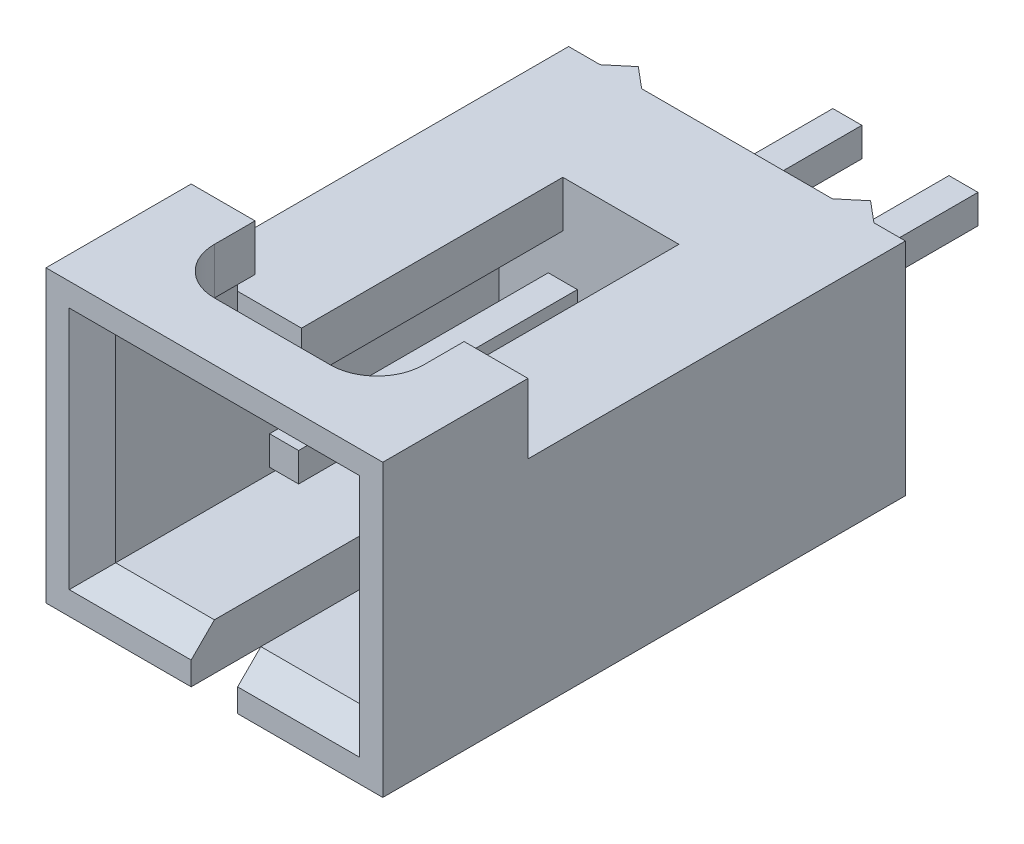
ISO-10303-21;
HEADER;
FILE_DESCRIPTION(('STEP AP214'),'2;1');
FILE_NAME('part.step','',(''),(''),'','','');
FILE_SCHEMA(('AUTOMOTIVE_DESIGN { 1 0 10303 214 1 1 1 1 }'));
ENDSEC;
DATA;
#1=APPLICATION_CONTEXT('core data for automotive mechanical design processes');
#2=APPLICATION_PROTOCOL_DEFINITION('international standard','automotive_design',2000,#1);
#3=PRODUCT_CONTEXT('',#1,'mechanical');
#4=PRODUCT('Part','Part','',(#3));
#5=PRODUCT_RELATED_PRODUCT_CATEGORY('part','',(#4));
#6=PRODUCT_DEFINITION_FORMATION('','',#4);
#7=PRODUCT_DEFINITION_CONTEXT('part definition',#1,'design');
#8=PRODUCT_DEFINITION('design','',#6,#7);
#9=PRODUCT_DEFINITION_SHAPE('','',#8);
#10=(LENGTH_UNIT() NAMED_UNIT(*) SI_UNIT(.MILLI.,.METRE.));
#11=(NAMED_UNIT(*) PLANE_ANGLE_UNIT() SI_UNIT($,.RADIAN.));
#12=(NAMED_UNIT(*) SI_UNIT($,.STERADIAN.) SOLID_ANGLE_UNIT());
#13=UNCERTAINTY_MEASURE_WITH_UNIT(LENGTH_MEASURE(1.E-05),#10,'distance_accuracy_value','');
#14=(GEOMETRIC_REPRESENTATION_CONTEXT(3) GLOBAL_UNCERTAINTY_ASSIGNED_CONTEXT((#13)) GLOBAL_UNIT_ASSIGNED_CONTEXT((#10,
#11,#12)) REPRESENTATION_CONTEXT('',''));
#15=CARTESIAN_POINT('',(0.,0.,0.));
#16=DIRECTION('',(0.,0.,1.));
#17=DIRECTION('',(1.,0.,0.));
#18=AXIS2_PLACEMENT_3D('',#15,#16,#17);
#19=CARTESIAN_POINT('',(0.952500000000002,-0.339066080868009,-9.64437999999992));
#20=DIRECTION('',(-0.999999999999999,0.,0.));
#21=DIRECTION('',(0.,0.,0.999999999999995));
#22=AXIS2_PLACEMENT_3D('',#19,#20,#21);
#23=PLANE('',#22);
#24=DIRECTION('',(0.,0.,0.999999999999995));
#25=VECTOR('',#24,1.);
#26=CARTESIAN_POINT('',(0.952499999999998,0.317499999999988,-3.23849999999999));
#27=LINE('',#26,#25);
#28=CARTESIAN_POINT('',(0.952499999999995,0.317500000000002,-3.17499999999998));
#29=VERTEX_POINT('',#28);
#30=CARTESIAN_POINT('',(0.952499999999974,0.317500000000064,2.92099999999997));
#31=VERTEX_POINT('',#30);
#32=EDGE_CURVE('E659',#29,#31,#27,.T.);
#33=ORIENTED_EDGE('',*,*,#32,.F.);
#34=DIRECTION('',(0.,-1.,0.));
#35=VECTOR('',#34,1.);
#36=CARTESIAN_POINT('',(0.952499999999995,0.,-3.17499999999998));
#37=LINE('',#36,#35);
#38=CARTESIAN_POINT('',(0.952499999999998,-0.317500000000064,-3.17499999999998));
#39=VERTEX_POINT('',#38);
#40=EDGE_CURVE('E680',#29,#39,#37,.T.);
#41=ORIENTED_EDGE('',*,*,#40,.T.);
#42=DIRECTION('',(0.,0.,0.999999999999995));
#43=VECTOR('',#42,1.);
#44=CARTESIAN_POINT('',(0.952499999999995,-0.317500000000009,-3.23849999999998));
#45=LINE('',#44,#43);
#46=CARTESIAN_POINT('',(0.952499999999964,-0.31750000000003,2.92099999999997));
#47=VERTEX_POINT('',#46);
#48=EDGE_CURVE('E252',#39,#47,#45,.T.);
#49=ORIENTED_EDGE('',*,*,#48,.T.);
#50=DIRECTION('',(0.,1.,0.));
#51=VECTOR('',#50,1.);
#52=CARTESIAN_POINT('',(0.952499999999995,0.,2.92099999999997));
#53=LINE('',#52,#51);
#54=EDGE_CURVE('E683',#47,#31,#53,.T.);
#55=ORIENTED_EDGE('',*,*,#54,.T.);
#56=EDGE_LOOP('',(#33,#41,#49,#55));
#57=FACE_BOUND('',#56,.T.);
#58=ADVANCED_FACE('F16',(#57),#23,.T.);
#59=CARTESIAN_POINT('',(-1.58749999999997,-0.339066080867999,-9.64437999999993));
#60=DIRECTION('',(-0.999999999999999,0.,0.));
#61=DIRECTION('',(0.,0.,0.999999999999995));
#62=AXIS2_PLACEMENT_3D('',#59,#60,#61);
#63=PLANE('',#62);
#64=DIRECTION('',(0.,0.,0.999999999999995));
#65=VECTOR('',#64,1.);
#66=CARTESIAN_POINT('',(-1.5875,0.317499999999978,-3.23849999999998));
#67=LINE('',#66,#65);
#68=CARTESIAN_POINT('',(-1.5875,0.317500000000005,-3.17499999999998));
#69=VERTEX_POINT('',#68);
#70=CARTESIAN_POINT('',(-1.5875,0.317499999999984,2.92099999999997));
#71=VERTEX_POINT('',#70);
#72=EDGE_CURVE('E644',#69,#71,#67,.T.);
#73=ORIENTED_EDGE('',*,*,#72,.F.);
#74=DIRECTION('',(0.,-1.,0.));
#75=VECTOR('',#74,1.);
#76=CARTESIAN_POINT('',(-1.5875,0.,-3.17499999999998));
#77=LINE('',#76,#75);
#78=CARTESIAN_POINT('',(-1.58750000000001,-0.317500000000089,-3.17499999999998));
#79=VERTEX_POINT('',#78);
#80=EDGE_CURVE('E676',#69,#79,#77,.T.);
#81=ORIENTED_EDGE('',*,*,#80,.T.);
#82=DIRECTION('',(0.,0.,0.999999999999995));
#83=VECTOR('',#82,1.);
#84=CARTESIAN_POINT('',(-1.5875,-0.317500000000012,-3.23849999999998));
#85=LINE('',#84,#83);
#86=CARTESIAN_POINT('',(-1.58750000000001,-0.317500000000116,2.92099999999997));
#87=VERTEX_POINT('',#86);
#88=EDGE_CURVE('E650',#79,#87,#85,.T.);
#89=ORIENTED_EDGE('',*,*,#88,.T.);
#90=DIRECTION('',(0.,1.,0.));
#91=VECTOR('',#90,1.);
#92=CARTESIAN_POINT('',(-1.58749999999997,0.,2.92099999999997));
#93=LINE('',#92,#91);
#94=EDGE_CURVE('E677',#87,#71,#93,.T.);
#95=ORIENTED_EDGE('',*,*,#94,.T.);
#96=EDGE_LOOP('',(#73,#81,#89,#95));
#97=FACE_BOUND('',#96,.T.);
#98=ADVANCED_FACE('F1159',(#97),#63,.T.);
#99=CARTESIAN_POINT('',(-2.77367999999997,2.794,5.26033999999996));
#100=DIRECTION('',(0.,1.,0.));
#101=DIRECTION('',(0.999999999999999,0.,0.));
#102=AXIS2_PLACEMENT_3D('',#99,#100,#101);
#103=PLANE('',#102);
#104=DIRECTION('',(0.999999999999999,0.,0.));
#105=VECTOR('',#104,1.);
#106=CARTESIAN_POINT('',(0.,2.79399999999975,4.44499999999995));
#107=LINE('',#106,#105);
#108=CARTESIAN_POINT('',(-1.26999999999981,2.79399999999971,4.44499999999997));
#109=VERTEX_POINT('',#108);
#110=CARTESIAN_POINT('',(1.26999999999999,2.79399999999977,4.44499999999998));
#111=VERTEX_POINT('',#110);
#112=EDGE_CURVE('E194',#109,#111,#107,.T.);
#113=ORIENTED_EDGE('',*,*,#112,.T.);
#114=CARTESIAN_POINT('',(1.27,2.7939999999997,3.42899999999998));
#115=DIRECTION('',(0.,1.,0.));
#116=DIRECTION('',(0.,0.,0.999999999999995));
#117=AXIS2_PLACEMENT_3D('',#114,#115,#116);
#118=CIRCLE('',#117,1.016);
#119=CARTESIAN_POINT('',(2.28599999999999,2.79399999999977,3.42900000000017));
#120=VERTEX_POINT('',#119);
#121=EDGE_CURVE('E20',#120,#111,#118,.F.);
#122=ORIENTED_EDGE('',*,*,#121,.F.);
#123=DIRECTION('',(0.,0.,-0.999999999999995));
#124=VECTOR('',#123,1.);
#125=CARTESIAN_POINT('',(2.28599999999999,2.79399999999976,2.98450000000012));
#126=LINE('',#125,#124);
#127=CARTESIAN_POINT('',(2.28599999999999,2.7939999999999,2.54000000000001));
#128=VERTEX_POINT('',#127);
#129=EDGE_CURVE('E191',#120,#128,#126,.T.);
#130=ORIENTED_EDGE('',*,*,#129,.T.);
#131=DIRECTION('',(-0.999999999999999,0.,0.));
#132=VECTOR('',#131,1.);
#133=CARTESIAN_POINT('',(0.,2.79399999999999,2.54));
#134=LINE('',#133,#132);
#135=CARTESIAN_POINT('',(2.66699999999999,2.79400000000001,2.53999999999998));
#136=VERTEX_POINT('',#135);
#137=EDGE_CURVE('E250',#136,#128,#134,.T.);
#138=ORIENTED_EDGE('',*,*,#137,.F.);
#139=DIRECTION('',(0.,0.,0.999999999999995));
#140=VECTOR('',#139,1.);
#141=CARTESIAN_POINT('',(2.667,2.794,1.01599999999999));
#142=LINE('',#141,#140);
#143=CARTESIAN_POINT('',(2.66699999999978,2.79399999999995,5.20699999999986));
#144=VERTEX_POINT('',#143);
#145=EDGE_CURVE('E257',#136,#144,#142,.T.);
#146=ORIENTED_EDGE('',*,*,#145,.T.);
#147=DIRECTION('',(-0.999999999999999,0.,0.));
#148=VECTOR('',#147,1.);
#149=CARTESIAN_POINT('',(0.,2.79399999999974,5.20699999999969));
#150=LINE('',#149,#148);
#151=CARTESIAN_POINT('',(-2.66699999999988,2.79399999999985,5.20699999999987));
#152=VERTEX_POINT('',#151);
#153=EDGE_CURVE('E294',#144,#152,#150,.T.);
#154=ORIENTED_EDGE('',*,*,#153,.T.);
#155=DIRECTION('',(0.,0.,-0.999999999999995));
#156=VECTOR('',#155,1.);
#157=CARTESIAN_POINT('',(-2.667,2.794,1.016));
#158=LINE('',#157,#156);
#159=CARTESIAN_POINT('',(-2.66699999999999,2.79399999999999,2.53999999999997));
#160=VERTEX_POINT('',#159);
#161=EDGE_CURVE('E276',#152,#160,#158,.T.);
#162=ORIENTED_EDGE('',*,*,#161,.T.);
#163=DIRECTION('',(-0.999999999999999,0.,0.));
#164=VECTOR('',#163,1.);
#165=CARTESIAN_POINT('',(0.,2.79399999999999,2.54));
#166=LINE('',#165,#164);
#167=CARTESIAN_POINT('',(-2.28599999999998,2.79399999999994,2.53999999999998));
#168=VERTEX_POINT('',#167);
#169=EDGE_CURVE('E253',#168,#160,#166,.T.);
#170=ORIENTED_EDGE('',*,*,#169,.F.);
#171=DIRECTION('',(0.,0.,-0.999999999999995));
#172=VECTOR('',#171,1.);
#173=CARTESIAN_POINT('',(-2.28599999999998,2.794,3.87349999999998));
#174=LINE('',#173,#172);
#175=CARTESIAN_POINT('',(-2.28599999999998,2.79399999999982,3.42900000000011));
#176=VERTEX_POINT('',#175);
#177=EDGE_CURVE('E270',#176,#168,#174,.T.);
#178=ORIENTED_EDGE('',*,*,#177,.F.);
#179=CARTESIAN_POINT('',(-1.26999999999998,2.79399999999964,3.429));
#180=DIRECTION('',(0.,1.,0.));
#181=DIRECTION('',(0.,0.,0.999999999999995));
#182=AXIS2_PLACEMENT_3D('',#179,#180,#181);
#183=CIRCLE('',#182,1.016);
#184=EDGE_CURVE('E433',#109,#176,#183,.F.);
#185=ORIENTED_EDGE('',*,*,#184,.F.);
#186=EDGE_LOOP('',(#113,#122,#130,#138,#146,#154,#162,#170,#178,#185));
#187=FACE_BOUND('',#186,.T.);
#188=ADVANCED_FACE('F190',(#187),#103,.F.);
#189=CARTESIAN_POINT('',(1.60906608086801,-0.317500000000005,-9.64437999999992));
#190=DIRECTION('',(0.,1.,0.));
#191=DIRECTION('',(-0.999999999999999,0.,0.));
#192=AXIS2_PLACEMENT_3D('',#189,#190,#191);
#193=PLANE('',#192);
#194=DIRECTION('',(0.,0.,-0.999999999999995));
#195=VECTOR('',#194,1.);
#196=CARTESIAN_POINT('',(1.5875,-0.31750000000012,-3.23849999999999));
#197=LINE('',#196,#195);
#198=CARTESIAN_POINT('',(1.5875,-0.317500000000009,2.92099999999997));
#199=VERTEX_POINT('',#198);
#200=CARTESIAN_POINT('',(1.5875,-0.317500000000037,-3.17499999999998));
#201=VERTEX_POINT('',#200);
#202=EDGE_CURVE('E281',#199,#201,#197,.T.);
#203=ORIENTED_EDGE('',*,*,#202,.F.);
#204=DIRECTION('',(0.999999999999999,0.,0.));
#205=VECTOR('',#204,1.);
#206=CARTESIAN_POINT('',(1.27,-0.31750000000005,2.92099999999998));
#207=LINE('',#206,#205);
#208=EDGE_CURVE('E656',#47,#199,#207,.T.);
#209=ORIENTED_EDGE('',*,*,#208,.F.);
#210=ORIENTED_EDGE('',*,*,#48,.F.);
#211=DIRECTION('',(-0.999999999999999,0.,0.));
#212=VECTOR('',#211,1.);
#213=CARTESIAN_POINT('',(1.26999999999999,-0.317500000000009,-3.17499999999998));
#214=LINE('',#213,#212);
#215=EDGE_CURVE('E665',#201,#39,#214,.T.);
#216=ORIENTED_EDGE('',*,*,#215,.F.);
#217=EDGE_LOOP('',(#203,#209,#210,#216));
#218=FACE_BOUND('',#217,.T.);
#219=ADVANCED_FACE('F700',(#218),#193,.F.);
#220=CARTESIAN_POINT('',(1.60906608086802,0.317499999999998,-9.64437999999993));
#221=DIRECTION('',(0.,1.,0.));
#222=DIRECTION('',(-0.999999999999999,0.,0.));
#223=AXIS2_PLACEMENT_3D('',#220,#221,#222);
#224=PLANE('',#223);
#225=ORIENTED_EDGE('',*,*,#32,.T.);
#226=DIRECTION('',(-0.999999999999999,0.,0.));
#227=VECTOR('',#226,1.);
#228=CARTESIAN_POINT('',(1.27000000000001,0.317500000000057,2.92099999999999));
#229=LINE('',#228,#227);
#230=CARTESIAN_POINT('',(1.5875,0.31750000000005,2.92099999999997));
#231=VERTEX_POINT('',#230);
#232=EDGE_CURVE('E653',#231,#31,#229,.T.);
#233=ORIENTED_EDGE('',*,*,#232,.F.);
#234=DIRECTION('',(0.,0.,0.999999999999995));
#235=VECTOR('',#234,1.);
#236=CARTESIAN_POINT('',(1.5875,0.317499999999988,-3.23849999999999));
#237=LINE('',#236,#235);
#238=CARTESIAN_POINT('',(1.5875,0.317500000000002,-3.17499999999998));
#239=VERTEX_POINT('',#238);
#240=EDGE_CURVE('E627',#239,#231,#237,.T.);
#241=ORIENTED_EDGE('',*,*,#240,.F.);
#242=DIRECTION('',(-0.999999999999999,0.,0.));
#243=VECTOR('',#242,1.);
#244=CARTESIAN_POINT('',(1.26999999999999,0.317500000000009,-3.17499999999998));
#245=LINE('',#244,#243);
#246=EDGE_CURVE('E662',#239,#29,#245,.T.);
#247=ORIENTED_EDGE('',*,*,#246,.T.);
#248=EDGE_LOOP('',(#225,#233,#241,#247));
#249=FACE_BOUND('',#248,.T.);
#250=ADVANCED_FACE('F1028',(#249),#224,.T.);
#251=CARTESIAN_POINT('',(0.930933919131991,-0.33906608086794,2.92099999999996));
#252=DIRECTION('',(0.,0.,0.999999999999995));
#253=DIRECTION('',(0.999999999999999,0.,0.));
#254=AXIS2_PLACEMENT_3D('',#251,#252,#253);
#255=PLANE('',#254);
#256=ORIENTED_EDGE('',*,*,#232,.T.);
#257=ORIENTED_EDGE('',*,*,#54,.F.);
#258=ORIENTED_EDGE('',*,*,#208,.T.);
#259=DIRECTION('',(0.,-1.,0.));
#260=VECTOR('',#259,1.);
#261=CARTESIAN_POINT('',(1.58750000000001,0.,2.92099999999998));
#262=LINE('',#261,#260);
#263=EDGE_CURVE('E620',#231,#199,#262,.T.);
#264=ORIENTED_EDGE('',*,*,#263,.F.);
#265=EDGE_LOOP('',(#256,#257,#258,#264));
#266=FACE_BOUND('',#265,.T.);
#267=ADVANCED_FACE('F1031',(#266),#255,.T.);
#268=CARTESIAN_POINT('',(-0.930933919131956,-0.317500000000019,-9.64437999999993));
#269=DIRECTION('',(0.,1.,0.));
#270=DIRECTION('',(-0.999999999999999,0.,0.));
#271=AXIS2_PLACEMENT_3D('',#268,#269,#270);
#272=PLANE('',#271);
#273=DIRECTION('',(0.,0.,-0.999999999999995));
#274=VECTOR('',#273,1.);
#275=CARTESIAN_POINT('',(-0.952500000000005,-0.317500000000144,-3.23849999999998));
#276=LINE('',#275,#274);
#277=CARTESIAN_POINT('',(-0.952499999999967,-0.317500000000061,2.92099999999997));
#278=VERTEX_POINT('',#277);
#279=CARTESIAN_POINT('',(-0.952499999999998,-0.317500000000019,-3.17499999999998));
#280=VERTEX_POINT('',#279);
#281=EDGE_CURVE('E616',#278,#280,#276,.T.);
#282=ORIENTED_EDGE('',*,*,#281,.F.);
#283=DIRECTION('',(0.999999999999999,0.,0.));
#284=VECTOR('',#283,1.);
#285=CARTESIAN_POINT('',(-1.26999999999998,-0.317500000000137,2.92099999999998));
#286=LINE('',#285,#284);
#287=EDGE_CURVE('E638',#87,#278,#286,.T.);
#288=ORIENTED_EDGE('',*,*,#287,.F.);
#289=ORIENTED_EDGE('',*,*,#88,.F.);
#290=DIRECTION('',(-0.999999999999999,0.,0.));
#291=VECTOR('',#290,1.);
#292=CARTESIAN_POINT('',(-1.27,-0.317500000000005,-3.17499999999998));
#293=LINE('',#292,#291);
#294=EDGE_CURVE('E647',#280,#79,#293,.T.);
#295=ORIENTED_EDGE('',*,*,#294,.F.);
#296=EDGE_LOOP('',(#282,#288,#289,#295));
#297=FACE_BOUND('',#296,.T.);
#298=ADVANCED_FACE('F1005',(#297),#272,.F.);
#299=CARTESIAN_POINT('',(-0.930933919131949,0.317499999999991,-9.64437999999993));
#300=DIRECTION('',(0.,1.,0.));
#301=DIRECTION('',(-0.999999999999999,0.,0.));
#302=AXIS2_PLACEMENT_3D('',#299,#300,#301);
#303=PLANE('',#302);
#304=DIRECTION('',(0.,0.,0.999999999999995));
#305=VECTOR('',#304,1.);
#306=CARTESIAN_POINT('',(-0.952500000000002,0.317499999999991,-3.23849999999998));
#307=LINE('',#306,#305);
#308=CARTESIAN_POINT('',(-0.952499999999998,0.317499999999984,-3.17499999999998));
#309=VERTEX_POINT('',#308);
#310=CARTESIAN_POINT('',(-0.952499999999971,0.317499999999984,2.92099999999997));
#311=VERTEX_POINT('',#310);
#312=EDGE_CURVE('E619',#309,#311,#307,.T.);
#313=ORIENTED_EDGE('',*,*,#312,.F.);
#314=DIRECTION('',(-0.999999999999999,0.,0.));
#315=VECTOR('',#314,1.);
#316=CARTESIAN_POINT('',(-1.27,0.317499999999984,-3.17499999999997));
#317=LINE('',#316,#315);
#318=EDGE_CURVE('E641',#309,#69,#317,.T.);
#319=ORIENTED_EDGE('',*,*,#318,.T.);
#320=ORIENTED_EDGE('',*,*,#72,.T.);
#321=DIRECTION('',(-0.999999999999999,0.,0.));
#322=VECTOR('',#321,1.);
#323=CARTESIAN_POINT('',(-1.26999999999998,0.317499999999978,2.92099999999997));
#324=LINE('',#323,#322);
#325=EDGE_CURVE('E199',#311,#71,#324,.T.);
#326=ORIENTED_EDGE('',*,*,#325,.F.);
#327=EDGE_LOOP('',(#313,#319,#320,#326));
#328=FACE_BOUND('',#327,.T.);
#329=ADVANCED_FACE('F996',(#328),#303,.T.);
#330=CARTESIAN_POINT('',(-1.60906608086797,-0.339066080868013,2.92099999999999));
#331=DIRECTION('',(0.,0.,0.999999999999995));
#332=DIRECTION('',(0.999999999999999,0.,0.));
#333=AXIS2_PLACEMENT_3D('',#330,#331,#332);
#334=PLANE('',#333);
#335=ORIENTED_EDGE('',*,*,#325,.T.);
#336=ORIENTED_EDGE('',*,*,#94,.F.);
#337=ORIENTED_EDGE('',*,*,#287,.T.);
#338=DIRECTION('',(0.,-1.,0.));
#339=VECTOR('',#338,1.);
#340=CARTESIAN_POINT('',(-0.952499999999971,0.,2.92099999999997));
#341=LINE('',#340,#339);
#342=EDGE_CURVE('E615',#311,#278,#341,.T.);
#343=ORIENTED_EDGE('',*,*,#342,.F.);
#344=EDGE_LOOP('',(#335,#336,#337,#343));
#345=FACE_BOUND('',#344,.T.);
#346=ADVANCED_FACE('F1044',(#345),#334,.T.);
#347=CARTESIAN_POINT('',(1.27,2.7939999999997,3.42899999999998));
#348=DIRECTION('',(0.,1.,0.));
#349=DIRECTION('',(0.,0.,0.999999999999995));
#350=AXIS2_PLACEMENT_3D('',#347,#348,#349);
#351=CYLINDRICAL_SURFACE('',#350,1.016);
#352=ORIENTED_EDGE('',*,*,#121,.T.);
#353=DIRECTION('',(0.,1.,0.));
#354=VECTOR('',#353,1.);
#355=CARTESIAN_POINT('',(1.27,3.30200000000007,4.44499999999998));
#356=LINE('',#355,#354);
#357=CARTESIAN_POINT('',(1.27,3.81000000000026,4.44499999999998));
#358=VERTEX_POINT('',#357);
#359=EDGE_CURVE('E218',#111,#358,#356,.T.);
#360=ORIENTED_EDGE('',*,*,#359,.T.);
#361=CARTESIAN_POINT('',(1.27,3.81000000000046,3.42899999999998));
#362=DIRECTION('',(0.,1.,0.));
#363=DIRECTION('',(0.,0.,0.999999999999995));
#364=AXIS2_PLACEMENT_3D('',#361,#362,#363);
#365=CIRCLE('',#364,1.016);
#366=CARTESIAN_POINT('',(2.286,3.81000000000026,3.42900000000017));
#367=VERTEX_POINT('',#366);
#368=EDGE_CURVE('E210',#367,#358,#365,.F.);
#369=ORIENTED_EDGE('',*,*,#368,.F.);
#370=DIRECTION('',(0.,-1.,0.));
#371=VECTOR('',#370,1.);
#372=CARTESIAN_POINT('',(2.286,3.30200000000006,3.42900000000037));
#373=LINE('',#372,#371);
#374=EDGE_CURVE('E203',#367,#120,#373,.T.);
#375=ORIENTED_EDGE('',*,*,#374,.T.);
#376=EDGE_LOOP('',(#352,#360,#369,#375));
#377=FACE_BOUND('',#376,.T.);
#378=ADVANCED_FACE('F209',(#377),#351,.F.);
#379=CARTESIAN_POINT('',(-1.32079999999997,2.77243391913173,4.44499999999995));
#380=DIRECTION('',(0.,0.,0.999999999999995));
#381=DIRECTION('',(0.999999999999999,0.,0.));
#382=AXIS2_PLACEMENT_3D('',#379,#380,#381);
#383=PLANE('',#382);
#384=ORIENTED_EDGE('',*,*,#112,.F.);
#385=DIRECTION('',(0.,-1.,0.));
#386=VECTOR('',#385,1.);
#387=CARTESIAN_POINT('',(-1.26999999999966,3.302,4.44499999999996));
#388=LINE('',#387,#386);
#389=CARTESIAN_POINT('',(-1.26999999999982,3.8100000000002,4.44499999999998));
#390=VERTEX_POINT('',#389);
#391=EDGE_CURVE('E435',#390,#109,#388,.T.);
#392=ORIENTED_EDGE('',*,*,#391,.F.);
#393=DIRECTION('',(-0.999999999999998,0.,0.));
#394=VECTOR('',#393,1.);
#395=CARTESIAN_POINT('',(0.,3.81,4.44499999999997));
#396=LINE('',#395,#394);
#397=EDGE_CURVE('E420',#358,#390,#396,.T.);
#398=ORIENTED_EDGE('',*,*,#397,.F.);
#399=ORIENTED_EDGE('',*,*,#359,.F.);
#400=EDGE_LOOP('',(#384,#392,#398,#399));
#401=FACE_BOUND('',#400,.T.);
#402=ADVANCED_FACE('F1047',(#401),#383,.F.);
#403=CARTESIAN_POINT('',(-1.26999999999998,2.79399999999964,3.429));
#404=DIRECTION('',(0.,1.,0.));
#405=DIRECTION('',(0.,0.,0.999999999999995));
#406=AXIS2_PLACEMENT_3D('',#403,#404,#405);
#407=CYLINDRICAL_SURFACE('',#406,1.016);
#408=ORIENTED_EDGE('',*,*,#184,.T.);
#409=DIRECTION('',(0.,1.,0.));
#410=VECTOR('',#409,1.);
#411=CARTESIAN_POINT('',(-2.28599999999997,3.30199999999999,3.42900000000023));
#412=LINE('',#411,#410);
#413=CARTESIAN_POINT('',(-2.28599999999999,3.8100000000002,3.42900000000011));
#414=VERTEX_POINT('',#413);
#415=EDGE_CURVE('E232',#176,#414,#412,.T.);
#416=ORIENTED_EDGE('',*,*,#415,.T.);
#417=CARTESIAN_POINT('',(-1.26999999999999,3.81000000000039,3.429));
#418=DIRECTION('',(0.,1.,0.));
#419=DIRECTION('',(0.,0.,0.999999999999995));
#420=AXIS2_PLACEMENT_3D('',#417,#418,#419);
#421=CIRCLE('',#420,1.016);
#422=EDGE_CURVE('E416',#390,#414,#421,.F.);
#423=ORIENTED_EDGE('',*,*,#422,.F.);
#424=ORIENTED_EDGE('',*,*,#391,.T.);
#425=EDGE_LOOP('',(#408,#416,#423,#424));
#426=FACE_BOUND('',#425,.T.);
#427=ADVANCED_FACE('F1050',(#426),#407,.F.);
#428=CARTESIAN_POINT('',(3.30199999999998,-2.04724952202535,5.73024952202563));
#429=DIRECTION('',(0.,-0.707106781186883,-0.707106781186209));
#430=DIRECTION('',(-0.999999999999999,0.,0.));
#431=AXIS2_PLACEMENT_3D('',#428,#429,#430);
#432=PLANE('',#431);
#433=DIRECTION('',(-0.577350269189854,-0.577350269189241,0.577350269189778));
#434=VECTOR('',#433,1.);
#435=CARTESIAN_POINT('',(-2.66699999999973,-1.52399999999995,5.20699999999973));
#436=LINE('',#435,#434);
#437=CARTESIAN_POINT('',(-2.66699999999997,-1.52400000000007,5.20699999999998));
#438=VERTEX_POINT('',#437);
#439=CARTESIAN_POINT('',(-3.17500000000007,-2.03199999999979,5.71499999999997));
#440=VERTEX_POINT('',#439);
#441=EDGE_CURVE('E298',#438,#440,#436,.T.);
#442=ORIENTED_EDGE('',*,*,#441,.T.);
#443=DIRECTION('',(-0.999999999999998,0.,0.));
#444=VECTOR('',#443,1.);
#445=CARTESIAN_POINT('',(0.,-2.03199999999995,5.71499999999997));
#446=LINE('',#445,#444);
#447=CARTESIAN_POINT('',(-0.507999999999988,-2.03199999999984,5.71499999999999));
#448=VERTEX_POINT('',#447);
#449=EDGE_CURVE('E286',#448,#440,#446,.T.);
#450=ORIENTED_EDGE('',*,*,#449,.F.);
#451=DIRECTION('',(0.,0.707106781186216,-0.707106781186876));
#452=VECTOR('',#451,1.);
#453=CARTESIAN_POINT('',(-0.507999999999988,-2.04724952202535,5.73024952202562));
#454=LINE('',#453,#452);
#455=CARTESIAN_POINT('',(-0.507999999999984,-1.52399999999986,5.2069999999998));
#456=VERTEX_POINT('',#455);
#457=EDGE_CURVE('E335',#448,#456,#454,.T.);
#458=ORIENTED_EDGE('',*,*,#457,.T.);
#459=DIRECTION('',(-0.999999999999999,0.,0.));
#460=VECTOR('',#459,1.);
#461=CARTESIAN_POINT('',(0.,-1.52399999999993,5.20699999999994));
#462=LINE('',#461,#460);
#463=EDGE_CURVE('E282',#456,#438,#462,.T.);
#464=ORIENTED_EDGE('',*,*,#463,.T.);
#465=EDGE_LOOP('',(#442,#450,#458,#464));
#466=FACE_BOUND('',#465,.T.);
#467=ADVANCED_FACE('F1052',(#466),#432,.F.);
#468=CARTESIAN_POINT('',(-3.19024952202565,-2.13867999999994,5.73024952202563));
#469=DIRECTION('',(-0.707106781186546,0.,-0.707106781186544));
#470=DIRECTION('',(0.,1.,0.));
#471=AXIS2_PLACEMENT_3D('',#468,#469,#470);
#472=PLANE('',#471);
#473=DIRECTION('',(0.,1.,0.));
#474=VECTOR('',#473,1.);
#475=CARTESIAN_POINT('',(-2.66699999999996,0.635000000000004,5.20699999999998));
#476=LINE('',#475,#474);
#477=EDGE_CURVE('E273',#438,#152,#476,.T.);
#478=ORIENTED_EDGE('',*,*,#477,.T.);
#479=DIRECTION('',(-0.577350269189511,0.577350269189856,0.577350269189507));
#480=VECTOR('',#479,1.);
#481=CARTESIAN_POINT('',(-2.66699999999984,2.79399999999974,5.20699999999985));
#482=LINE('',#481,#480);
#483=CARTESIAN_POINT('',(-3.17499999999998,3.30200000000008,5.71499999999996));
#484=VERTEX_POINT('',#483);
#485=EDGE_CURVE('E297',#152,#484,#482,.T.);
#486=ORIENTED_EDGE('',*,*,#485,.T.);
#487=DIRECTION('',(0.,1.,0.));
#488=VECTOR('',#487,1.);
#489=CARTESIAN_POINT('',(-3.17499999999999,0.634999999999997,5.71499999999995));
#490=LINE('',#489,#488);
#491=EDGE_CURVE('E288',#440,#484,#490,.T.);
#492=ORIENTED_EDGE('',*,*,#491,.F.);
#493=ORIENTED_EDGE('',*,*,#441,.F.);
#494=EDGE_LOOP('',(#478,#486,#492,#493));
#495=FACE_BOUND('',#494,.T.);
#496=ADVANCED_FACE('F1055',(#495),#472,.F.);
#497=CARTESIAN_POINT('',(-3.30199999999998,3.31724952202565,5.7302495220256));
#498=DIRECTION('',(0.,0.707106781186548,-0.707106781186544));
#499=DIRECTION('',(0.999999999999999,0.,0.));
#500=AXIS2_PLACEMENT_3D('',#497,#498,#499);
#501=PLANE('',#500);
#502=ORIENTED_EDGE('',*,*,#153,.F.);
#503=DIRECTION('',(0.577350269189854,0.577350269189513,0.577350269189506));
#504=VECTOR('',#503,1.);
#505=CARTESIAN_POINT('',(2.66699999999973,2.79399999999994,5.20699999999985));
#506=LINE('',#505,#504);
#507=CARTESIAN_POINT('',(3.17500000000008,3.30200000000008,5.71499999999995));
#508=VERTEX_POINT('',#507);
#509=EDGE_CURVE('E427',#144,#508,#506,.T.);
#510=ORIENTED_EDGE('',*,*,#509,.T.);
#511=DIRECTION('',(0.999999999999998,0.,0.));
#512=VECTOR('',#511,1.);
#513=CARTESIAN_POINT('',(0.,3.30200000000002,5.71499999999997));
#514=LINE('',#513,#512);
#515=EDGE_CURVE('E291',#484,#508,#514,.T.);
#516=ORIENTED_EDGE('',*,*,#515,.F.);
#517=ORIENTED_EDGE('',*,*,#485,.F.);
#518=EDGE_LOOP('',(#502,#510,#516,#517));
#519=FACE_BOUND('',#518,.T.);
#520=ADVANCED_FACE('F1059',(#519),#501,.F.);
#521=CARTESIAN_POINT('',(3.19024952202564,3.40868000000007,5.73024952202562));
#522=DIRECTION('',(0.707106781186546,0.,-0.707106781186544));
#523=DIRECTION('',(0.,-1.,0.));
#524=AXIS2_PLACEMENT_3D('',#521,#522,#523);
#525=PLANE('',#524);
#526=DIRECTION('',(0.,-1.,0.));
#527=VECTOR('',#526,1.);
#528=CARTESIAN_POINT('',(2.66700000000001,0.635000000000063,5.20699999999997));
#529=LINE('',#528,#527);
#530=CARTESIAN_POINT('',(2.66699999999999,-1.52400000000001,5.20699999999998));
#531=VERTEX_POINT('',#530);
#532=EDGE_CURVE('E260',#144,#531,#529,.T.);
#533=ORIENTED_EDGE('',*,*,#532,.T.);
#534=DIRECTION('',(0.577350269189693,-0.577350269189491,0.577350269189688));
#535=VECTOR('',#534,1.);
#536=CARTESIAN_POINT('',(2.66699999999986,-1.52399999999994,5.20699999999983));
#537=LINE('',#536,#535);
#538=CARTESIAN_POINT('',(3.17499999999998,-2.03199999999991,5.71499999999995));
#539=VERTEX_POINT('',#538);
#540=EDGE_CURVE('E365',#531,#539,#537,.T.);
#541=ORIENTED_EDGE('',*,*,#540,.T.);
#542=DIRECTION('',(0.,-1.,0.));
#543=VECTOR('',#542,1.);
#544=CARTESIAN_POINT('',(3.17500000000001,0.635000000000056,5.71499999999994));
#545=LINE('',#544,#543);
#546=EDGE_CURVE('E300',#508,#539,#545,.T.);
#547=ORIENTED_EDGE('',*,*,#546,.F.);
#548=ORIENTED_EDGE('',*,*,#509,.F.);
#549=EDGE_LOOP('',(#533,#541,#547,#548));
#550=FACE_BOUND('',#549,.T.);
#551=ADVANCED_FACE('F1063',(#550),#525,.F.);
#552=CARTESIAN_POINT('',(3.30199999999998,-2.04724952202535,5.73024952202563));
#553=DIRECTION('',(0.,-0.707106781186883,-0.707106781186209));
#554=DIRECTION('',(-0.999999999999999,0.,0.));
#555=AXIS2_PLACEMENT_3D('',#552,#553,#554);
#556=PLANE('',#555);
#557=ORIENTED_EDGE('',*,*,#540,.F.);
#558=DIRECTION('',(-0.999999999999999,0.,0.));
#559=VECTOR('',#558,1.);
#560=CARTESIAN_POINT('',(0.,-1.52399999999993,5.20699999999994));
#561=LINE('',#560,#559);
#562=CARTESIAN_POINT('',(0.507999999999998,-1.52399999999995,5.20699999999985));
#563=VERTEX_POINT('',#562);
#564=EDGE_CURVE('E305',#531,#563,#561,.T.);
#565=ORIENTED_EDGE('',*,*,#564,.T.);
#566=DIRECTION('',(0.,0.707106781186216,-0.707106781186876));
#567=VECTOR('',#566,1.);
#568=CARTESIAN_POINT('',(0.508000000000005,-2.04724952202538,5.73024952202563));
#569=LINE('',#568,#567);
#570=CARTESIAN_POINT('',(0.508000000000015,-2.03199999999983,5.71499999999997));
#571=VERTEX_POINT('',#570);
#572=EDGE_CURVE('E325',#563,#571,#569,.F.);
#573=ORIENTED_EDGE('',*,*,#572,.T.);
#574=DIRECTION('',(-0.999999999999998,0.,0.));
#575=VECTOR('',#574,1.);
#576=CARTESIAN_POINT('',(0.,-2.03199999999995,5.71499999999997));
#577=LINE('',#576,#575);
#578=EDGE_CURVE('E304',#539,#571,#577,.T.);
#579=ORIENTED_EDGE('',*,*,#578,.F.);
#580=EDGE_LOOP('',(#557,#565,#573,#579));
#581=FACE_BOUND('',#580,.T.);
#582=ADVANCED_FACE('F1067',(#581),#556,.F.);
#583=CARTESIAN_POINT('',(-3.83032000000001,-2.63652000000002,-5.71499999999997));
#584=DIRECTION('',(0.,0.,0.999999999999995));
#585=DIRECTION('',(0.999999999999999,0.,0.));
#586=AXIS2_PLACEMENT_3D('',#583,#584,#585);
#587=PLANE('',#586);
#588=DIRECTION('',(0.,1.,0.));
#589=VECTOR('',#588,1.);
#590=CARTESIAN_POINT('',(3.683,0.635000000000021,-5.71499999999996));
#591=LINE('',#590,#589);
#592=CARTESIAN_POINT('',(3.68299999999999,-2.54000000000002,-5.71499999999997));
#593=VERTEX_POINT('',#592);
#594=CARTESIAN_POINT('',(3.68300000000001,2.28600000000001,-5.71499999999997));
#595=VERTEX_POINT('',#594);
#596=EDGE_CURVE('E222',#593,#595,#591,.T.);
#597=ORIENTED_EDGE('',*,*,#596,.F.);
#598=DIRECTION('',(0.999999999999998,0.,0.));
#599=VECTOR('',#598,1.);
#600=CARTESIAN_POINT('',(0.,-2.54000000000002,-5.71499999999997));
#601=LINE('',#600,#599);
#602=CARTESIAN_POINT('',(2.99405811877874,-2.54000000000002,-5.7149999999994));
#603=VERTEX_POINT('',#602);
#604=EDGE_CURVE('E214',#603,#593,#601,.T.);
#605=ORIENTED_EDGE('',*,*,#604,.F.);
#606=DIRECTION('',(0.,-1.,0.));
#607=VECTOR('',#606,1.);
#608=CARTESIAN_POINT('',(2.99405811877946,-0.127000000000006,-5.71499999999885));
#609=LINE('',#608,#607);
#610=CARTESIAN_POINT('',(2.99405811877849,2.28600000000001,-5.71499999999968));
#611=VERTEX_POINT('',#610);
#612=EDGE_CURVE('E366',#611,#603,#609,.T.);
#613=ORIENTED_EDGE('',*,*,#612,.F.);
#614=DIRECTION('',(-0.999999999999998,0.,0.));
#615=VECTOR('',#614,1.);
#616=CARTESIAN_POINT('',(0.,2.28600000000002,-5.71499999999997));
#617=LINE('',#616,#615);
#618=EDGE_CURVE('E211',#595,#611,#617,.T.);
#619=ORIENTED_EDGE('',*,*,#618,.F.);
#620=EDGE_LOOP('',(#597,#605,#613,#619));
#621=FACE_BOUND('',#620,.T.);
#622=ADVANCED_FACE('F962',(#621),#587,.F.);
#623=CARTESIAN_POINT('',(2.28599999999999,2.77243391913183,3.45056608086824));
#624=DIRECTION('',(0.999999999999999,0.,0.));
#625=DIRECTION('',(0.,0.,-0.999999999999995));
#626=AXIS2_PLACEMENT_3D('',#623,#624,#625);
#627=PLANE('',#626);
#628=ORIENTED_EDGE('',*,*,#129,.F.);
#629=ORIENTED_EDGE('',*,*,#374,.F.);
#630=DIRECTION('',(0.,0.,0.999999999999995));
#631=VECTOR('',#630,1.);
#632=CARTESIAN_POINT('',(2.286,3.81000000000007,4.12749999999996));
#633=LINE('',#632,#631);
#634=CARTESIAN_POINT('',(2.28599999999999,3.81000000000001,2.54));
#635=VERTEX_POINT('',#634);
#636=EDGE_CURVE('E422',#635,#367,#633,.T.);
#637=ORIENTED_EDGE('',*,*,#636,.F.);
#638=DIRECTION('',(0.,-1.,0.));
#639=VECTOR('',#638,1.);
#640=CARTESIAN_POINT('',(2.28599999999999,3.04800000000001,2.54000000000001));
#641=LINE('',#640,#639);
#642=EDGE_CURVE('E205',#635,#128,#641,.T.);
#643=ORIENTED_EDGE('',*,*,#642,.T.);
#644=EDGE_LOOP('',(#628,#629,#637,#643));
#645=FACE_BOUND('',#644,.T.);
#646=ADVANCED_FACE('F201',(#645),#627,.F.);
#647=CARTESIAN_POINT('',(1.24205999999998,1.79324952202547,2.55524952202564));
#648=DIRECTION('',(0.,0.707106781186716,-0.707106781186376));
#649=DIRECTION('',(0.999999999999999,0.,0.));
#650=AXIS2_PLACEMENT_3D('',#647,#648,#649);
#651=PLANE('',#650);
#652=DIRECTION('',(0.999999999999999,0.,0.));
#653=VECTOR('',#652,1.);
#654=CARTESIAN_POINT('',(0.,1.27,2.03199999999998));
#655=LINE('',#654,#653);
#656=CARTESIAN_POINT('',(1.26999999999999,1.27000000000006,2.03199999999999));
#657=VERTEX_POINT('',#656);
#658=CARTESIAN_POINT('',(2.667,1.27,2.03199999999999));
#659=VERTEX_POINT('',#658);
#660=EDGE_CURVE('E206',#657,#659,#655,.T.);
#661=ORIENTED_EDGE('',*,*,#660,.T.);
#662=DIRECTION('',(0.,-0.707106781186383,-0.707106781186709));
#663=VECTOR('',#662,1.);
#664=CARTESIAN_POINT('',(2.66699999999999,1.7932495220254,2.55524952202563));
#665=LINE('',#664,#663);
#666=CARTESIAN_POINT('',(2.66699999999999,1.77799999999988,2.53999999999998));
#667=VERTEX_POINT('',#666);
#668=EDGE_CURVE('E261',#659,#667,#665,.F.);
#669=ORIENTED_EDGE('',*,*,#668,.T.);
#670=DIRECTION('',(0.999999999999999,0.,0.));
#671=VECTOR('',#670,1.);
#672=CARTESIAN_POINT('',(0.,1.77799999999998,2.54));
#673=LINE('',#672,#671);
#674=CARTESIAN_POINT('',(1.26999999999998,1.77799999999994,2.53999999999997));
#675=VERTEX_POINT('',#674);
#676=EDGE_CURVE('E228',#675,#667,#673,.T.);
#677=ORIENTED_EDGE('',*,*,#676,.F.);
#678=DIRECTION('',(0.,-0.707106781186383,-0.707106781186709));
#679=VECTOR('',#678,1.);
#680=CARTESIAN_POINT('',(1.26999999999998,1.79324952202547,2.55524952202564));
#681=LINE('',#680,#679);
#682=EDGE_CURVE('E338',#675,#657,#681,.T.);
#683=ORIENTED_EDGE('',*,*,#682,.T.);
#684=EDGE_LOOP('',(#661,#669,#677,#683));
#685=FACE_BOUND('',#684,.T.);
#686=ADVANCED_FACE('F1076',(#685),#651,.F.);
#687=CARTESIAN_POINT('',(2.77367999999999,1.26999999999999,-3.27913999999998));
#688=DIRECTION('',(0.,1.,0.));
#689=DIRECTION('',(-0.999999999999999,0.,0.));
#690=AXIS2_PLACEMENT_3D('',#687,#688,#689);
#691=PLANE('',#690);
#692=DIRECTION('',(0.,0.,0.999999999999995));
#693=VECTOR('',#692,1.);
#694=CARTESIAN_POINT('',(2.667,1.27,1.016));
#695=LINE('',#694,#693);
#696=CARTESIAN_POINT('',(2.66699999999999,1.26999999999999,-3.17499999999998));
#697=VERTEX_POINT('',#696);
#698=EDGE_CURVE('E311',#697,#659,#695,.T.);
#699=ORIENTED_EDGE('',*,*,#698,.T.);
#700=ORIENTED_EDGE('',*,*,#660,.F.);
#701=DIRECTION('',(0.,0.,-0.999999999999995));
#702=VECTOR('',#701,1.);
#703=CARTESIAN_POINT('',(1.26999999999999,1.27,-0.3175));
#704=LINE('',#703,#702);
#705=CARTESIAN_POINT('',(1.27,1.27,-3.17499999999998));
#706=VERTEX_POINT('',#705);
#707=EDGE_CURVE('E339',#657,#706,#704,.T.);
#708=ORIENTED_EDGE('',*,*,#707,.T.);
#709=DIRECTION('',(-0.999999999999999,0.,0.));
#710=VECTOR('',#709,1.);
#711=CARTESIAN_POINT('',(0.,1.26999999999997,-3.17499999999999));
#712=LINE('',#711,#710);
#713=EDGE_CURVE('E308',#697,#706,#712,.T.);
#714=ORIENTED_EDGE('',*,*,#713,.F.);
#715=EDGE_LOOP('',(#699,#700,#708,#714));
#716=FACE_BOUND('',#715,.T.);
#717=ADVANCED_FACE('F948',(#716),#691,.F.);
#718=CARTESIAN_POINT('',(2.77368,-1.52399999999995,5.37463999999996));
#719=DIRECTION('',(0.,-1.,0.));
#720=DIRECTION('',(-0.999999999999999,0.,0.));
#721=AXIS2_PLACEMENT_3D('',#718,#719,#720);
#722=PLANE('',#721);
#723=DIRECTION('',(0.,0.,-0.999999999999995));
#724=VECTOR('',#723,1.);
#725=CARTESIAN_POINT('',(2.667,-1.52399999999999,1.016));
#726=LINE('',#725,#724);
#727=CARTESIAN_POINT('',(2.66699999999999,-1.524,-3.17499999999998));
#728=VERTEX_POINT('',#727);
#729=EDGE_CURVE('E307',#531,#728,#726,.T.);
#730=ORIENTED_EDGE('',*,*,#729,.T.);
#731=DIRECTION('',(0.999999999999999,0.,0.));
#732=VECTOR('',#731,1.);
#733=CARTESIAN_POINT('',(0.,-1.52400000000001,-3.17499999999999));
#734=LINE('',#733,#732);
#735=CARTESIAN_POINT('',(0.507999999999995,-1.52400000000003,-3.17499999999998));
#736=VERTEX_POINT('',#735);
#737=EDGE_CURVE('E342',#736,#728,#734,.T.);
#738=ORIENTED_EDGE('',*,*,#737,.F.);
#739=DIRECTION('',(0.,0.,0.999999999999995));
#740=VECTOR('',#739,1.);
#741=CARTESIAN_POINT('',(0.508000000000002,-1.52399999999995,1.26999999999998));
#742=LINE('',#741,#740);
#743=EDGE_CURVE('E322',#736,#563,#742,.T.);
#744=ORIENTED_EDGE('',*,*,#743,.T.);
#745=ORIENTED_EDGE('',*,*,#564,.F.);
#746=EDGE_LOOP('',(#730,#738,#744,#745));
#747=FACE_BOUND('',#746,.T.);
#748=ADVANCED_FACE('F935',(#747),#722,.F.);
#749=CARTESIAN_POINT('',(2.667,2.88036000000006,5.37463999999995));
#750=DIRECTION('',(0.999999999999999,0.,0.));
#751=DIRECTION('',(0.,-1.,0.));
#752=AXIS2_PLACEMENT_3D('',#749,#750,#751);
#753=PLANE('',#752);
#754=ORIENTED_EDGE('',*,*,#145,.F.);
#755=DIRECTION('',(0.,-1.,0.));
#756=VECTOR('',#755,1.);
#757=CARTESIAN_POINT('',(2.66699999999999,3.04800000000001,2.53999999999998));
#758=LINE('',#757,#756);
#759=CARTESIAN_POINT('',(2.66699999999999,2.286,2.53999999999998));
#760=VERTEX_POINT('',#759);
#761=EDGE_CURVE('E221',#136,#760,#758,.T.);
#762=ORIENTED_EDGE('',*,*,#761,.T.);
#763=DIRECTION('',(0.,1.,0.));
#764=VECTOR('',#763,1.);
#765=CARTESIAN_POINT('',(2.66699999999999,2.03200000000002,2.53999999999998));
#766=LINE('',#765,#764);
#767=EDGE_CURVE('E318',#667,#760,#766,.T.);
#768=ORIENTED_EDGE('',*,*,#767,.F.);
#769=ORIENTED_EDGE('',*,*,#668,.F.);
#770=ORIENTED_EDGE('',*,*,#698,.F.);
#771=DIRECTION('',(0.,1.,0.));
#772=VECTOR('',#771,1.);
#773=CARTESIAN_POINT('',(2.667,-0.126999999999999,-3.17499999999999));
#774=LINE('',#773,#772);
#775=EDGE_CURVE('E554',#728,#697,#774,.T.);
#776=ORIENTED_EDGE('',*,*,#775,.F.);
#777=ORIENTED_EDGE('',*,*,#729,.F.);
#778=ORIENTED_EDGE('',*,*,#532,.F.);
#779=EDGE_LOOP('',(#754,#762,#768,#769,#770,#776,#777,#778));
#780=FACE_BOUND('',#779,.T.);
#781=ADVANCED_FACE('F942',(#780),#753,.F.);
#782=CARTESIAN_POINT('',(-2.66699999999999,-1.61035999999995,5.37463999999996));
#783=DIRECTION('',(-0.999999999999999,0.,0.));
#784=DIRECTION('',(0.,1.,0.));
#785=AXIS2_PLACEMENT_3D('',#782,#783,#784);
#786=PLANE('',#785);
#787=ORIENTED_EDGE('',*,*,#161,.F.);
#788=ORIENTED_EDGE('',*,*,#477,.F.);
#789=DIRECTION('',(0.,0.,-0.999999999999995));
#790=VECTOR('',#789,1.);
#791=CARTESIAN_POINT('',(-2.66699999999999,-1.52399999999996,1.016));
#792=LINE('',#791,#790);
#793=CARTESIAN_POINT('',(-2.667,-1.52400000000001,-3.17499999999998));
#794=VERTEX_POINT('',#793);
#795=EDGE_CURVE('E278',#438,#794,#792,.T.);
#796=ORIENTED_EDGE('',*,*,#795,.T.);
#797=DIRECTION('',(0.,-1.,0.));
#798=VECTOR('',#797,1.);
#799=CARTESIAN_POINT('',(-2.667,-0.127000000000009,-3.17499999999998));
#800=LINE('',#799,#798);
#801=CARTESIAN_POINT('',(-2.667,1.26999999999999,-3.17499999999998));
#802=VERTEX_POINT('',#801);
#803=EDGE_CURVE('E563',#802,#794,#800,.T.);
#804=ORIENTED_EDGE('',*,*,#803,.F.);
#805=DIRECTION('',(0.,0.,0.999999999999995));
#806=VECTOR('',#805,1.);
#807=CARTESIAN_POINT('',(-2.66700000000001,1.26999999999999,-0.571499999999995));
#808=LINE('',#807,#806);
#809=CARTESIAN_POINT('',(-2.66699999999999,1.26999999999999,2.03199999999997));
#810=VERTEX_POINT('',#809);
#811=EDGE_CURVE('E346',#802,#810,#808,.T.);
#812=ORIENTED_EDGE('',*,*,#811,.T.);
#813=DIRECTION('',(0.,0.707106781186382,0.707106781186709));
#814=VECTOR('',#813,1.);
#815=CARTESIAN_POINT('',(-2.66699999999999,1.52399999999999,2.28600000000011));
#816=LINE('',#815,#814);
#817=CARTESIAN_POINT('',(-2.66699999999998,1.77800000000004,2.54000000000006));
#818=VERTEX_POINT('',#817);
#819=EDGE_CURVE('E235',#810,#818,#816,.T.);
#820=ORIENTED_EDGE('',*,*,#819,.T.);
#821=DIRECTION('',(0.,-1.,0.));
#822=VECTOR('',#821,1.);
#823=CARTESIAN_POINT('',(-2.66699999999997,0.63499999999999,2.53999999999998));
#824=LINE('',#823,#822);
#825=CARTESIAN_POINT('',(-2.66699999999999,2.286,2.53999999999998));
#826=VERTEX_POINT('',#825);
#827=EDGE_CURVE('E277',#826,#818,#824,.T.);
#828=ORIENTED_EDGE('',*,*,#827,.F.);
#829=DIRECTION('',(0.,-1.,0.));
#830=VECTOR('',#829,1.);
#831=CARTESIAN_POINT('',(-2.66699999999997,0.63499999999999,2.53999999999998));
#832=LINE('',#831,#830);
#833=EDGE_CURVE('E285',#160,#826,#832,.T.);
#834=ORIENTED_EDGE('',*,*,#833,.F.);
#835=EDGE_LOOP('',(#787,#788,#796,#804,#812,#820,#828,#834));
#836=FACE_BOUND('',#835,.T.);
#837=ADVANCED_FACE('F1086',(#836),#786,.F.);
#838=CARTESIAN_POINT('',(2.77368,-1.52399999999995,5.37463999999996));
#839=DIRECTION('',(0.,-1.,0.));
#840=DIRECTION('',(-0.999999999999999,0.,0.));
#841=AXIS2_PLACEMENT_3D('',#838,#839,#840);
#842=PLANE('',#841);
#843=ORIENTED_EDGE('',*,*,#795,.F.);
#844=ORIENTED_EDGE('',*,*,#463,.F.);
#845=DIRECTION('',(0.,0.,-0.999999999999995));
#846=VECTOR('',#845,1.);
#847=CARTESIAN_POINT('',(-0.507999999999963,-1.52399999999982,1.27));
#848=LINE('',#847,#846);
#849=CARTESIAN_POINT('',(-0.508000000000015,-1.52399999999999,-3.17499999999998));
#850=VERTEX_POINT('',#849);
#851=EDGE_CURVE('E332',#456,#850,#848,.T.);
#852=ORIENTED_EDGE('',*,*,#851,.T.);
#853=DIRECTION('',(0.999999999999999,0.,0.));
#854=VECTOR('',#853,1.);
#855=CARTESIAN_POINT('',(0.,-1.52400000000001,-3.17499999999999));
#856=LINE('',#855,#854);
#857=EDGE_CURVE('E566',#794,#850,#856,.T.);
#858=ORIENTED_EDGE('',*,*,#857,.F.);
#859=EDGE_LOOP('',(#843,#844,#852,#858));
#860=FACE_BOUND('',#859,.T.);
#861=ADVANCED_FACE('F1089',(#860),#842,.F.);
#862=CARTESIAN_POINT('',(1.5875,-0.33906608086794,3.16737999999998));
#863=DIRECTION('',(0.999999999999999,0.,0.));
#864=DIRECTION('',(0.,0.,-0.999999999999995));
#865=AXIS2_PLACEMENT_3D('',#862,#863,#864);
#866=PLANE('',#865);
#867=ORIENTED_EDGE('',*,*,#240,.T.);
#868=ORIENTED_EDGE('',*,*,#263,.T.);
#869=ORIENTED_EDGE('',*,*,#202,.T.);
#870=DIRECTION('',(0.,-1.,0.));
#871=VECTOR('',#870,1.);
#872=CARTESIAN_POINT('',(1.5875,-0.126999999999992,-3.17499999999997));
#873=LINE('',#872,#871);
#874=EDGE_CURVE('E575',#239,#201,#873,.T.);
#875=ORIENTED_EDGE('',*,*,#874,.F.);
#876=EDGE_LOOP('',(#867,#868,#869,#875));
#877=FACE_BOUND('',#876,.T.);
#878=ADVANCED_FACE('F710',(#877),#866,.T.);
#879=CARTESIAN_POINT('',(-0.952499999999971,-0.339066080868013,3.16737999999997));
#880=DIRECTION('',(0.999999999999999,0.,0.));
#881=DIRECTION('',(0.,0.,-0.999999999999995));
#882=AXIS2_PLACEMENT_3D('',#879,#880,#881);
#883=PLANE('',#882);
#884=ORIENTED_EDGE('',*,*,#312,.T.);
#885=ORIENTED_EDGE('',*,*,#342,.T.);
#886=ORIENTED_EDGE('',*,*,#281,.T.);
#887=DIRECTION('',(0.,-1.,0.));
#888=VECTOR('',#887,1.);
#889=CARTESIAN_POINT('',(-0.952499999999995,-0.127000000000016,-3.17499999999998));
#890=LINE('',#889,#888);
#891=EDGE_CURVE('E551',#309,#280,#890,.T.);
#892=ORIENTED_EDGE('',*,*,#891,.F.);
#893=EDGE_LOOP('',(#884,#885,#886,#892));
#894=FACE_BOUND('',#893,.T.);
#895=ADVANCED_FACE('F1000',(#894),#883,.T.);
#896=CARTESIAN_POINT('',(2.77367999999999,1.26999999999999,-3.27913999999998));
#897=DIRECTION('',(0.,1.,0.));
#898=DIRECTION('',(-0.999999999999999,0.,0.));
#899=AXIS2_PLACEMENT_3D('',#896,#897,#898);
#900=PLANE('',#899);
#901=ORIENTED_EDGE('',*,*,#811,.F.);
#902=DIRECTION('',(-0.999999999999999,0.,0.));
#903=VECTOR('',#902,1.);
#904=CARTESIAN_POINT('',(0.,1.26999999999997,-3.17499999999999));
#905=LINE('',#904,#903);
#906=CARTESIAN_POINT('',(-1.27,1.26999999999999,-3.17499999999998));
#907=VERTEX_POINT('',#906);
#908=EDGE_CURVE('E560',#907,#802,#905,.T.);
#909=ORIENTED_EDGE('',*,*,#908,.F.);
#910=DIRECTION('',(0.,0.,0.999999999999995));
#911=VECTOR('',#910,1.);
#912=CARTESIAN_POINT('',(-1.27,1.26999999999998,-0.3175));
#913=LINE('',#912,#911);
#914=CARTESIAN_POINT('',(-1.26999999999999,1.26999999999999,2.03199999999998));
#915=VERTEX_POINT('',#914);
#916=EDGE_CURVE('E347',#907,#915,#913,.T.);
#917=ORIENTED_EDGE('',*,*,#916,.T.);
#918=DIRECTION('',(-0.999999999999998,0.,0.));
#919=VECTOR('',#918,1.);
#920=CARTESIAN_POINT('',(-1.96849999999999,1.26999999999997,2.03199999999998));
#921=LINE('',#920,#919);
#922=EDGE_CURVE('E343',#915,#810,#921,.T.);
#923=ORIENTED_EDGE('',*,*,#922,.T.);
#924=EDGE_LOOP('',(#901,#909,#917,#923));
#925=FACE_BOUND('',#924,.T.);
#926=ADVANCED_FACE('F1098',(#925),#900,.F.);
#927=CARTESIAN_POINT('',(-2.69493999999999,1.79324952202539,2.55524952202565));
#928=DIRECTION('',(0.,0.707106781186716,-0.707106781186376));
#929=DIRECTION('',(0.999999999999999,0.,0.));
#930=AXIS2_PLACEMENT_3D('',#927,#928,#929);
#931=PLANE('',#930);
#932=ORIENTED_EDGE('',*,*,#922,.F.);
#933=DIRECTION('',(0.,-0.707106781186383,-0.707106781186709));
#934=VECTOR('',#933,1.);
#935=CARTESIAN_POINT('',(-1.26999999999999,1.79324952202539,2.55524952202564));
#936=LINE('',#935,#934);
#937=CARTESIAN_POINT('',(-1.26999999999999,1.77799999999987,2.53999999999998));
#938=VERTEX_POINT('',#937);
#939=EDGE_CURVE('E350',#915,#938,#936,.F.);
#940=ORIENTED_EDGE('',*,*,#939,.T.);
#941=DIRECTION('',(0.999999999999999,0.,0.));
#942=VECTOR('',#941,1.);
#943=CARTESIAN_POINT('',(0.,1.77799999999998,2.54));
#944=LINE('',#943,#942);
#945=EDGE_CURVE('E245',#818,#938,#944,.T.);
#946=ORIENTED_EDGE('',*,*,#945,.F.);
#947=ORIENTED_EDGE('',*,*,#819,.F.);
#948=EDGE_LOOP('',(#932,#940,#946,#947));
#949=FACE_BOUND('',#948,.T.);
#950=ADVANCED_FACE('F1101',(#949),#931,.F.);
#951=CARTESIAN_POINT('',(-2.28599999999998,2.77243391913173,2.51843391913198));
#952=DIRECTION('',(-0.999999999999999,0.,0.));
#953=DIRECTION('',(0.,0.,0.999999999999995));
#954=AXIS2_PLACEMENT_3D('',#951,#952,#953);
#955=PLANE('',#954);
#956=ORIENTED_EDGE('',*,*,#177,.T.);
#957=DIRECTION('',(0.,1.,0.));
#958=VECTOR('',#957,1.);
#959=CARTESIAN_POINT('',(-2.28599999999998,3.048,2.53999999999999));
#960=LINE('',#959,#958);
#961=CARTESIAN_POINT('',(-2.28599999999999,3.81,2.53999999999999));
#962=VERTEX_POINT('',#961);
#963=EDGE_CURVE('E240',#168,#962,#960,.T.);
#964=ORIENTED_EDGE('',*,*,#963,.T.);
#965=DIRECTION('',(0.,0.,-0.999999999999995));
#966=VECTOR('',#965,1.);
#967=CARTESIAN_POINT('',(-2.28599999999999,3.80999999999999,4.12749999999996));
#968=LINE('',#967,#966);
#969=EDGE_CURVE('E600',#414,#962,#968,.T.);
#970=ORIENTED_EDGE('',*,*,#969,.F.);
#971=ORIENTED_EDGE('',*,*,#415,.F.);
#972=EDGE_LOOP('',(#956,#964,#970,#971));
#973=FACE_BOUND('',#972,.T.);
#974=ADVANCED_FACE('F1105',(#973),#955,.F.);
#975=CARTESIAN_POINT('',(-3.83032000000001,-2.63652000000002,-5.71499999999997));
#976=DIRECTION('',(0.,0.,0.999999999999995));
#977=DIRECTION('',(0.999999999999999,0.,0.));
#978=AXIS2_PLACEMENT_3D('',#975,#976,#977);
#979=PLANE('',#978);
#980=DIRECTION('',(0.,-1.,0.));
#981=VECTOR('',#980,1.);
#982=CARTESIAN_POINT('',(-3.683,0.634999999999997,-5.71499999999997));
#983=LINE('',#982,#981);
#984=CARTESIAN_POINT('',(-3.68299999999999,2.286,-5.71499999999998));
#985=VERTEX_POINT('',#984);
#986=CARTESIAN_POINT('',(-3.68300000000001,-2.54000000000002,-5.71499999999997));
#987=VERTEX_POINT('',#986);
#988=EDGE_CURVE('E541',#985,#987,#983,.T.);
#989=ORIENTED_EDGE('',*,*,#988,.F.);
#990=DIRECTION('',(-0.999999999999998,0.,0.));
#991=VECTOR('',#990,1.);
#992=CARTESIAN_POINT('',(0.,2.28600000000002,-5.71499999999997));
#993=LINE('',#992,#991);
#994=CARTESIAN_POINT('',(-2.99405811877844,2.28600000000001,-5.71499999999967));
#995=VERTEX_POINT('',#994);
#996=EDGE_CURVE('E234',#995,#985,#993,.T.);
#997=ORIENTED_EDGE('',*,*,#996,.F.);
#998=DIRECTION('',(0.,1.,0.));
#999=VECTOR('',#998,1.);
#1000=CARTESIAN_POINT('',(-2.99405811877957,-0.127000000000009,-5.71499999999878));
#1001=LINE('',#1000,#999);
#1002=CARTESIAN_POINT('',(-2.9940581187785,-2.54000000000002,-5.71499999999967));
#1003=VERTEX_POINT('',#1002);
#1004=EDGE_CURVE('E395',#1003,#995,#1001,.T.);
#1005=ORIENTED_EDGE('',*,*,#1004,.F.);
#1006=DIRECTION('',(0.999999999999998,0.,0.));
#1007=VECTOR('',#1006,1.);
#1008=CARTESIAN_POINT('',(0.,-2.54000000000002,-5.71499999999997));
#1009=LINE('',#1008,#1007);
#1010=EDGE_CURVE('E602',#987,#1003,#1009,.T.);
#1011=ORIENTED_EDGE('',*,*,#1010,.F.);
#1012=EDGE_LOOP('',(#989,#997,#1005,#1011));
#1013=FACE_BOUND('',#1012,.T.);
#1014=ADVANCED_FACE('F981',(#1013),#979,.F.);
#1015=CARTESIAN_POINT('',(3.83032,3.81000000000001,2.4765));
#1016=DIRECTION('',(0.,1.,0.));
#1017=DIRECTION('',(-0.999999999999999,0.,0.));
#1018=AXIS2_PLACEMENT_3D('',#1015,#1016,#1017);
#1019=PLANE('',#1018);
#1020=ORIENTED_EDGE('',*,*,#397,.T.);
#1021=ORIENTED_EDGE('',*,*,#422,.T.);
#1022=ORIENTED_EDGE('',*,*,#969,.T.);
#1023=DIRECTION('',(-0.999999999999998,0.,0.));
#1024=VECTOR('',#1023,1.);
#1025=CARTESIAN_POINT('',(0.,3.80999999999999,2.54));
#1026=LINE('',#1025,#1024);
#1027=CARTESIAN_POINT('',(-3.68299999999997,3.80999999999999,2.53999999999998));
#1028=VERTEX_POINT('',#1027);
#1029=EDGE_CURVE('E236',#962,#1028,#1026,.T.);
#1030=ORIENTED_EDGE('',*,*,#1029,.T.);
#1031=DIRECTION('',(0.,0.,-0.999999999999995));
#1032=VECTOR('',#1031,1.);
#1033=CARTESIAN_POINT('',(-3.683,3.81,0.));
#1034=LINE('',#1033,#1032);
#1035=CARTESIAN_POINT('',(-3.68299999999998,3.81,5.71499999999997));
#1036=VERTEX_POINT('',#1035);
#1037=EDGE_CURVE('E537',#1036,#1028,#1034,.T.);
#1038=ORIENTED_EDGE('',*,*,#1037,.F.);
#1039=DIRECTION('',(-0.999999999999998,0.,0.));
#1040=VECTOR('',#1039,1.);
#1041=CARTESIAN_POINT('',(0.,3.81,5.71499999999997));
#1042=LINE('',#1041,#1040);
#1043=CARTESIAN_POINT('',(3.68299999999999,3.81000000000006,5.71499999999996));
#1044=VERTEX_POINT('',#1043);
#1045=EDGE_CURVE('E329',#1044,#1036,#1042,.T.);
#1046=ORIENTED_EDGE('',*,*,#1045,.F.);
#1047=DIRECTION('',(0.,0.,0.999999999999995));
#1048=VECTOR('',#1047,1.);
#1049=CARTESIAN_POINT('',(3.68299999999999,3.81000000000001,0.));
#1050=LINE('',#1049,#1048);
#1051=CARTESIAN_POINT('',(3.68299999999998,3.81000000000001,2.53999999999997));
#1052=VERTEX_POINT('',#1051);
#1053=EDGE_CURVE('E393',#1052,#1044,#1050,.T.);
#1054=ORIENTED_EDGE('',*,*,#1053,.F.);
#1055=DIRECTION('',(-0.999999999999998,0.,0.));
#1056=VECTOR('',#1055,1.);
#1057=CARTESIAN_POINT('',(0.,3.80999999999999,2.54));
#1058=LINE('',#1057,#1056);
#1059=EDGE_CURVE('E225',#1052,#635,#1058,.T.);
#1060=ORIENTED_EDGE('',*,*,#1059,.T.);
#1061=ORIENTED_EDGE('',*,*,#636,.T.);
#1062=ORIENTED_EDGE('',*,*,#368,.T.);
#1063=EDGE_LOOP('',(#1020,#1021,#1022,#1030,#1038,#1046,#1054,#1060,#1061,#1062));
#1064=FACE_BOUND('',#1063,.T.);
#1065=ADVANCED_FACE('F828',(#1064),#1019,.T.);
#1066=CARTESIAN_POINT('',(0.952500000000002,-0.339066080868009,-9.64437999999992));
#1067=DIRECTION('',(-0.999999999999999,0.,0.));
#1068=DIRECTION('',(0.,0.,0.999999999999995));
#1069=AXIS2_PLACEMENT_3D('',#1066,#1067,#1068);
#1070=PLANE('',#1069);
#1071=DIRECTION('',(0.,0.,0.999999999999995));
#1072=VECTOR('',#1071,1.);
#1073=CARTESIAN_POINT('',(0.952499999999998,0.317499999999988,-3.23849999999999));
#1074=LINE('',#1073,#1072);
#1075=CARTESIAN_POINT('',(0.952500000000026,0.317499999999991,-9.39799999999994));
#1076=VERTEX_POINT('',#1075);
#1077=CARTESIAN_POINT('',(0.952499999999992,0.317499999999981,-5.71499999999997));
#1078=VERTEX_POINT('',#1077);
#1079=EDGE_CURVE('E520',#1076,#1078,#1074,.T.);
#1080=ORIENTED_EDGE('',*,*,#1079,.F.);
#1081=DIRECTION('',(0.,1.,0.));
#1082=VECTOR('',#1081,1.);
#1083=CARTESIAN_POINT('',(0.952500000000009,0.,-9.39799999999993));
#1084=LINE('',#1083,#1082);
#1085=CARTESIAN_POINT('',(0.952499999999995,-0.317500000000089,-9.39799999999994));
#1086=VERTEX_POINT('',#1085);
#1087=EDGE_CURVE('E524',#1086,#1076,#1084,.T.);
#1088=ORIENTED_EDGE('',*,*,#1087,.F.);
#1089=DIRECTION('',(0.,0.,0.999999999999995));
#1090=VECTOR('',#1089,1.);
#1091=CARTESIAN_POINT('',(0.952499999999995,-0.317500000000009,-3.23849999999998));
#1092=LINE('',#1091,#1090);
#1093=CARTESIAN_POINT('',(0.952499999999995,-0.317500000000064,-5.71499999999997));
#1094=VERTEX_POINT('',#1093);
#1095=EDGE_CURVE('E534',#1086,#1094,#1092,.T.);
#1096=ORIENTED_EDGE('',*,*,#1095,.T.);
#1097=DIRECTION('',(0.,1.,0.));
#1098=VECTOR('',#1097,1.);
#1099=CARTESIAN_POINT('',(0.952499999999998,0.,-5.71499999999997));
#1100=LINE('',#1099,#1098);
#1101=EDGE_CURVE('E419',#1094,#1078,#1100,.T.);
#1102=ORIENTED_EDGE('',*,*,#1101,.T.);
#1103=EDGE_LOOP('',(#1080,#1088,#1096,#1102));
#1104=FACE_BOUND('',#1103,.T.);
#1105=ADVANCED_FACE('F818',(#1104),#1070,.T.);
#1106=CARTESIAN_POINT('',(-1.58749999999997,-0.339066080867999,-9.64437999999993));
#1107=DIRECTION('',(-0.999999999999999,0.,0.));
#1108=DIRECTION('',(0.,0.,0.999999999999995));
#1109=AXIS2_PLACEMENT_3D('',#1106,#1107,#1108);
#1110=PLANE('',#1109);
#1111=DIRECTION('',(0.,0.,0.999999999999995));
#1112=VECTOR('',#1111,1.);
#1113=CARTESIAN_POINT('',(-1.5875,0.317499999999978,-3.23849999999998));
#1114=LINE('',#1113,#1112);
#1115=CARTESIAN_POINT('',(-1.58749999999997,0.317499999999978,-9.39799999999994));
#1116=VERTEX_POINT('',#1115);
#1117=CARTESIAN_POINT('',(-1.58750000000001,0.317499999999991,-5.71499999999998));
#1118=VERTEX_POINT('',#1117);
#1119=EDGE_CURVE('E503',#1116,#1118,#1114,.T.);
#1120=ORIENTED_EDGE('',*,*,#1119,.F.);
#1121=DIRECTION('',(0.,1.,0.));
#1122=VECTOR('',#1121,1.);
#1123=CARTESIAN_POINT('',(-1.58749999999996,0.,-9.39799999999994));
#1124=LINE('',#1123,#1122);
#1125=CARTESIAN_POINT('',(-1.58749999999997,-0.317500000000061,-9.39799999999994));
#1126=VERTEX_POINT('',#1125);
#1127=EDGE_CURVE('E505',#1126,#1116,#1124,.T.);
#1128=ORIENTED_EDGE('',*,*,#1127,.F.);
#1129=DIRECTION('',(0.,0.,0.999999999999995));
#1130=VECTOR('',#1129,1.);
#1131=CARTESIAN_POINT('',(-1.5875,-0.317500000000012,-3.23849999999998));
#1132=LINE('',#1131,#1130);
#1133=CARTESIAN_POINT('',(-1.5875,-0.317500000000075,-5.71499999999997));
#1134=VERTEX_POINT('',#1133);
#1135=EDGE_CURVE('E515',#1126,#1134,#1132,.T.);
#1136=ORIENTED_EDGE('',*,*,#1135,.T.);
#1137=DIRECTION('',(0.,1.,0.));
#1138=VECTOR('',#1137,1.);
#1139=CARTESIAN_POINT('',(-1.5875,0.,-5.71499999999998));
#1140=LINE('',#1139,#1138);
#1141=EDGE_CURVE('E593',#1134,#1118,#1140,.T.);
#1142=ORIENTED_EDGE('',*,*,#1141,.T.);
#1143=EDGE_LOOP('',(#1120,#1128,#1136,#1142));
#1144=FACE_BOUND('',#1143,.T.);
#1145=ADVANCED_FACE('F815',(#1144),#1110,.T.);
#1146=CARTESIAN_POINT('',(-2.52347942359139,-2.63652,-6.10986240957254));
#1147=DIRECTION('',(-0.642787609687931,0.,-0.766044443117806));
#1148=DIRECTION('',(-0.766044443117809,0.,0.642787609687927));
#1149=AXIS2_PLACEMENT_3D('',#1146,#1147,#1148);
#1150=PLANE('',#1149);
#1151=DIRECTION('',(0.,1.,0.));
#1152=VECTOR('',#1151,1.);
#1153=CARTESIAN_POINT('',(-2.53999999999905,-0.127000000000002,-6.09600000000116));
#1154=LINE('',#1153,#1152);
#1155=CARTESIAN_POINT('',(-2.53999999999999,-2.54000000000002,-6.09600000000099));
#1156=VERTEX_POINT('',#1155);
#1157=CARTESIAN_POINT('',(-2.53999999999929,2.286,-6.09600000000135));
#1158=VERTEX_POINT('',#1157);
#1159=EDGE_CURVE('E373',#1156,#1158,#1154,.T.);
#1160=ORIENTED_EDGE('',*,*,#1159,.F.);
#1161=DIRECTION('',(-0.76604444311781,0.,0.642787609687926));
#1162=VECTOR('',#1161,1.);
#1163=CARTESIAN_POINT('',(-2.76702905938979,-2.54,-5.90549999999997));
#1164=LINE('',#1163,#1162);
#1165=EDGE_CURVE('E326',#1156,#1003,#1164,.T.);
#1166=ORIENTED_EDGE('',*,*,#1165,.T.);
#1167=ORIENTED_EDGE('',*,*,#1004,.T.);
#1168=DIRECTION('',(0.766044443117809,0.,-0.642787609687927));
#1169=VECTOR('',#1168,1.);
#1170=CARTESIAN_POINT('',(-2.76702905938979,2.286,-5.90549999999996));
#1171=LINE('',#1170,#1169);
#1172=EDGE_CURVE('E372',#995,#1158,#1171,.T.);
#1173=ORIENTED_EDGE('',*,*,#1172,.T.);
#1174=EDGE_LOOP('',(#1160,#1166,#1167,#1173));
#1175=FACE_BOUND('',#1174,.T.);
#1176=ADVANCED_FACE('F817',(#1175),#1150,.T.);
#1177=CARTESIAN_POINT('',(0.507999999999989,-2.56156608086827,-3.35279999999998));
#1178=DIRECTION('',(0.999999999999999,0.,0.));
#1179=DIRECTION('',(0.,1.,0.));
#1180=AXIS2_PLACEMENT_3D('',#1177,#1178,#1179);
#1181=PLANE('',#1180);
#1182=ORIENTED_EDGE('',*,*,#743,.F.);
#1183=DIRECTION('',(0.,1.,0.));
#1184=VECTOR('',#1183,1.);
#1185=CARTESIAN_POINT('',(0.508000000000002,-0.126999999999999,-3.17499999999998));
#1186=LINE('',#1185,#1184);
#1187=CARTESIAN_POINT('',(0.507999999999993,-2.5400000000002,-3.17499999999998));
#1188=VERTEX_POINT('',#1187);
#1189=EDGE_CURVE('E572',#1188,#736,#1186,.T.);
#1190=ORIENTED_EDGE('',*,*,#1189,.F.);
#1191=DIRECTION('',(0.,0.,-0.999999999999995));
#1192=VECTOR('',#1191,1.);
#1193=CARTESIAN_POINT('',(0.507999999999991,-2.54000000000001,-0.190500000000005));
#1194=LINE('',#1193,#1192);
#1195=CARTESIAN_POINT('',(0.507999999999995,-2.54000000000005,5.71499999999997));
#1196=VERTEX_POINT('',#1195);
#1197=EDGE_CURVE('E489',#1196,#1188,#1194,.T.);
#1198=ORIENTED_EDGE('',*,*,#1197,.F.);
#1199=DIRECTION('',(0.,-1.,0.));
#1200=VECTOR('',#1199,1.);
#1201=CARTESIAN_POINT('',(0.508000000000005,0.635000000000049,5.71499999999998));
#1202=LINE('',#1201,#1200);
#1203=EDGE_CURVE('E313',#571,#1196,#1202,.T.);
#1204=ORIENTED_EDGE('',*,*,#1203,.F.);
#1205=ORIENTED_EDGE('',*,*,#572,.F.);
#1206=EDGE_LOOP('',(#1182,#1190,#1198,#1204,#1205));
#1207=FACE_BOUND('',#1206,.T.);
#1208=ADVANCED_FACE('F825',(#1207),#1181,.F.);
#1209=CARTESIAN_POINT('',(-0.508000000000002,-1.50243391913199,-3.35279999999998));
#1210=DIRECTION('',(-0.999999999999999,0.,0.));
#1211=DIRECTION('',(0.,-1.,0.));
#1212=AXIS2_PLACEMENT_3D('',#1209,#1210,#1211);
#1213=PLANE('',#1212);
#1214=DIRECTION('',(0.,-1.,0.));
#1215=VECTOR('',#1214,1.);
#1216=CARTESIAN_POINT('',(-0.507999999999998,-0.127000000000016,-3.17499999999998));
#1217=LINE('',#1216,#1215);
#1218=CARTESIAN_POINT('',(-0.508000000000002,-2.54000000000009,-3.17499999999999));
#1219=VERTEX_POINT('',#1218);
#1220=EDGE_CURVE('E569',#850,#1219,#1217,.T.);
#1221=ORIENTED_EDGE('',*,*,#1220,.F.);
#1222=ORIENTED_EDGE('',*,*,#851,.F.);
#1223=ORIENTED_EDGE('',*,*,#457,.F.);
#1224=DIRECTION('',(0.,1.,0.));
#1225=VECTOR('',#1224,1.);
#1226=CARTESIAN_POINT('',(-0.508000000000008,0.634999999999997,5.71499999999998));
#1227=LINE('',#1226,#1225);
#1228=CARTESIAN_POINT('',(-0.507999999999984,-2.54000000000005,5.71499999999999));
#1229=VERTEX_POINT('',#1228);
#1230=EDGE_CURVE('E289',#1229,#448,#1227,.T.);
#1231=ORIENTED_EDGE('',*,*,#1230,.F.);
#1232=DIRECTION('',(0.,0.,0.999999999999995));
#1233=VECTOR('',#1232,1.);
#1234=CARTESIAN_POINT('',(-0.507999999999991,-2.54,-0.190499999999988));
#1235=LINE('',#1234,#1233);
#1236=EDGE_CURVE('E495',#1219,#1229,#1235,.T.);
#1237=ORIENTED_EDGE('',*,*,#1236,.F.);
#1238=EDGE_LOOP('',(#1221,#1222,#1223,#1231,#1237));
#1239=FACE_BOUND('',#1238,.T.);
#1240=ADVANCED_FACE('F918',(#1239),#1213,.F.);
#1241=CARTESIAN_POINT('',(-3.83031999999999,-2.66699999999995,5.71499999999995));
#1242=DIRECTION('',(0.,0.,0.999999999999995));
#1243=DIRECTION('',(0.999999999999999,0.,0.));
#1244=AXIS2_PLACEMENT_3D('',#1241,#1242,#1243);
#1245=PLANE('',#1244);
#1246=DIRECTION('',(0.,1.,0.));
#1247=VECTOR('',#1246,1.);
#1248=CARTESIAN_POINT('',(-3.68299999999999,0.635000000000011,5.71499999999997));
#1249=LINE('',#1248,#1247);
#1250=CARTESIAN_POINT('',(-3.68299999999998,-2.53999999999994,5.71499999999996));
#1251=VERTEX_POINT('',#1250);
#1252=EDGE_CURVE('E544',#1251,#1036,#1249,.T.);
#1253=ORIENTED_EDGE('',*,*,#1252,.F.);
#1254=DIRECTION('',(-0.999999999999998,0.,0.));
#1255=VECTOR('',#1254,1.);
#1256=CARTESIAN_POINT('',(0.,-2.53999999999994,5.71499999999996));
#1257=LINE('',#1256,#1255);
#1258=EDGE_CURVE('E498',#1229,#1251,#1257,.T.);
#1259=ORIENTED_EDGE('',*,*,#1258,.F.);
#1260=ORIENTED_EDGE('',*,*,#1230,.T.);
#1261=ORIENTED_EDGE('',*,*,#449,.T.);
#1262=ORIENTED_EDGE('',*,*,#491,.T.);
#1263=ORIENTED_EDGE('',*,*,#515,.T.);
#1264=ORIENTED_EDGE('',*,*,#546,.T.);
#1265=ORIENTED_EDGE('',*,*,#578,.T.);
#1266=ORIENTED_EDGE('',*,*,#1203,.T.);
#1267=DIRECTION('',(-0.999999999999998,0.,0.));
#1268=VECTOR('',#1267,1.);
#1269=CARTESIAN_POINT('',(0.,-2.53999999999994,5.71499999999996));
#1270=LINE('',#1269,#1268);
#1271=CARTESIAN_POINT('',(3.68299999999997,-2.53999999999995,5.71499999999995));
#1272=VERTEX_POINT('',#1271);
#1273=EDGE_CURVE('E486',#1272,#1196,#1270,.T.);
#1274=ORIENTED_EDGE('',*,*,#1273,.F.);
#1275=DIRECTION('',(0.,-1.,0.));
#1276=VECTOR('',#1275,1.);
#1277=CARTESIAN_POINT('',(3.68300000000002,0.63500000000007,5.71499999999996));
#1278=LINE('',#1277,#1276);
#1279=EDGE_CURVE('E584',#1044,#1272,#1278,.T.);
#1280=ORIENTED_EDGE('',*,*,#1279,.F.);
#1281=ORIENTED_EDGE('',*,*,#1045,.T.);
#1282=EDGE_LOOP('',(#1253,#1259,#1260,#1261,#1262,#1263,#1264,#1265,#1266,#1274,#1280,#1281));
#1283=FACE_BOUND('',#1282,.T.);
#1284=ADVANCED_FACE('F914',(#1283),#1245,.T.);
#1285=CARTESIAN_POINT('',(3.0105786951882,-2.63652000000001,-5.70113759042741));
#1286=DIRECTION('',(0.642787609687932,0.,-0.766044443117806));
#1287=DIRECTION('',(-0.766044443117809,0.,-0.642787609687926));
#1288=AXIS2_PLACEMENT_3D('',#1285,#1286,#1287);
#1289=PLANE('',#1288);
#1290=DIRECTION('',(0.,-1.,0.));
#1291=VECTOR('',#1290,1.);
#1292=CARTESIAN_POINT('',(2.53999999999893,-0.127000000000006,-6.09600000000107));
#1293=LINE('',#1292,#1291);
#1294=CARTESIAN_POINT('',(2.53999999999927,2.28600000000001,-6.09600000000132));
#1295=VERTEX_POINT('',#1294);
#1296=CARTESIAN_POINT('',(2.53999999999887,-2.54,-6.09600000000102));
#1297=VERTEX_POINT('',#1296);
#1298=EDGE_CURVE('E357',#1295,#1297,#1293,.T.);
#1299=ORIENTED_EDGE('',*,*,#1298,.F.);
#1300=DIRECTION('',(0.766044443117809,0.,0.642787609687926));
#1301=VECTOR('',#1300,1.);
#1302=CARTESIAN_POINT('',(2.76702905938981,2.28600000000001,-5.90549999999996));
#1303=LINE('',#1302,#1301);
#1304=EDGE_CURVE('E369',#1295,#611,#1303,.T.);
#1305=ORIENTED_EDGE('',*,*,#1304,.T.);
#1306=ORIENTED_EDGE('',*,*,#612,.T.);
#1307=DIRECTION('',(0.766044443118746,0.,0.642787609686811));
#1308=VECTOR('',#1307,1.);
#1309=CARTESIAN_POINT('',(2.53999999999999,-2.54000000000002,-6.09599999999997));
#1310=LINE('',#1309,#1308);
#1311=EDGE_CURVE('E360',#1297,#603,#1310,.T.);
#1312=ORIENTED_EDGE('',*,*,#1311,.F.);
#1313=EDGE_LOOP('',(#1299,#1305,#1306,#1312));
#1314=FACE_BOUND('',#1313,.T.);
#1315=ADVANCED_FACE('F910',(#1314),#1289,.T.);
#1316=CARTESIAN_POINT('',(3.683,-2.66700000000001,-5.94359999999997));
#1317=DIRECTION('',(0.999999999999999,0.,0.));
#1318=DIRECTION('',(0.,1.,0.));
#1319=AXIS2_PLACEMENT_3D('',#1316,#1317,#1318);
#1320=PLANE('',#1319);
#1321=ORIENTED_EDGE('',*,*,#596,.T.);
#1322=DIRECTION('',(0.,0.,0.999999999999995));
#1323=VECTOR('',#1322,1.);
#1324=CARTESIAN_POINT('',(3.683,2.286,-1.77799999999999));
#1325=LINE('',#1324,#1323);
#1326=CARTESIAN_POINT('',(3.68299999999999,2.28600000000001,2.53999999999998));
#1327=VERTEX_POINT('',#1326);
#1328=EDGE_CURVE('E403',#595,#1327,#1325,.T.);
#1329=ORIENTED_EDGE('',*,*,#1328,.T.);
#1330=DIRECTION('',(0.,1.,0.));
#1331=VECTOR('',#1330,1.);
#1332=CARTESIAN_POINT('',(3.68299999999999,3.04800000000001,2.53999999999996));
#1333=LINE('',#1332,#1331);
#1334=EDGE_CURVE('E229',#1327,#1052,#1333,.T.);
#1335=ORIENTED_EDGE('',*,*,#1334,.T.);
#1336=ORIENTED_EDGE('',*,*,#1053,.T.);
#1337=ORIENTED_EDGE('',*,*,#1279,.T.);
#1338=DIRECTION('',(0.,0.,0.999999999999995));
#1339=VECTOR('',#1338,1.);
#1340=CARTESIAN_POINT('',(3.68299999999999,-2.54,-0.190500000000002));
#1341=LINE('',#1340,#1339);
#1342=EDGE_CURVE('E376',#593,#1272,#1341,.T.);
#1343=ORIENTED_EDGE('',*,*,#1342,.F.);
#1344=EDGE_LOOP('',(#1321,#1329,#1335,#1336,#1337,#1343));
#1345=FACE_BOUND('',#1344,.T.);
#1346=ADVANCED_FACE('F906',(#1345),#1320,.T.);
#1347=CARTESIAN_POINT('',(-3.83031999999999,3.84048,2.53999999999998));
#1348=DIRECTION('',(0.,0.,0.999999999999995));
#1349=DIRECTION('',(0.,-1.,0.));
#1350=AXIS2_PLACEMENT_3D('',#1347,#1348,#1349);
#1351=PLANE('',#1350);
#1352=ORIENTED_EDGE('',*,*,#1334,.F.);
#1353=DIRECTION('',(-0.999999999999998,0.,0.));
#1354=VECTOR('',#1353,1.);
#1355=CARTESIAN_POINT('',(0.,2.28600000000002,2.54));
#1356=LINE('',#1355,#1354);
#1357=EDGE_CURVE('E461',#1327,#760,#1356,.T.);
#1358=ORIENTED_EDGE('',*,*,#1357,.T.);
#1359=ORIENTED_EDGE('',*,*,#761,.F.);
#1360=ORIENTED_EDGE('',*,*,#137,.T.);
#1361=ORIENTED_EDGE('',*,*,#642,.F.);
#1362=ORIENTED_EDGE('',*,*,#1059,.F.);
#1363=EDGE_LOOP('',(#1352,#1358,#1359,#1360,#1361,#1362));
#1364=FACE_BOUND('',#1363,.T.);
#1365=ADVANCED_FACE('F902',(#1364),#1351,.F.);
#1366=CARTESIAN_POINT('',(-2.77367999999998,2.30756608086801,2.54));
#1367=DIRECTION('',(0.,0.,0.999999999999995));
#1368=DIRECTION('',(0.,-1.,0.));
#1369=AXIS2_PLACEMENT_3D('',#1366,#1367,#1368);
#1370=PLANE('',#1369);
#1371=ORIENTED_EDGE('',*,*,#767,.T.);
#1372=DIRECTION('',(-0.999999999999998,0.,0.));
#1373=VECTOR('',#1372,1.);
#1374=CARTESIAN_POINT('',(0.,2.28600000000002,2.54));
#1375=LINE('',#1374,#1373);
#1376=CARTESIAN_POINT('',(1.26999999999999,2.28600000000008,2.53999999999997));
#1377=VERTEX_POINT('',#1376);
#1378=EDGE_CURVE('E464',#760,#1377,#1375,.T.);
#1379=ORIENTED_EDGE('',*,*,#1378,.T.);
#1380=DIRECTION('',(0.,-1.,0.));
#1381=VECTOR('',#1380,1.);
#1382=CARTESIAN_POINT('',(1.26999999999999,1.77800000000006,2.53999999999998));
#1383=LINE('',#1382,#1381);
#1384=EDGE_CURVE('E321',#1377,#675,#1383,.T.);
#1385=ORIENTED_EDGE('',*,*,#1384,.T.);
#1386=ORIENTED_EDGE('',*,*,#676,.T.);
#1387=EDGE_LOOP('',(#1371,#1379,#1385,#1386));
#1388=FACE_BOUND('',#1387,.T.);
#1389=ADVANCED_FACE('F898',(#1388),#1370,.T.);
#1390=CARTESIAN_POINT('',(1.26999999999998,1.24843391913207,2.65429999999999));
#1391=DIRECTION('',(0.999999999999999,0.,0.));
#1392=DIRECTION('',(0.,0.,-0.999999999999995));
#1393=AXIS2_PLACEMENT_3D('',#1390,#1391,#1392);
#1394=PLANE('',#1393);
#1395=ORIENTED_EDGE('',*,*,#707,.F.);
#1396=ORIENTED_EDGE('',*,*,#682,.F.);
#1397=ORIENTED_EDGE('',*,*,#1384,.F.);
#1398=DIRECTION('',(0.,0.,-0.999999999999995));
#1399=VECTOR('',#1398,1.);
#1400=CARTESIAN_POINT('',(1.26999999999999,2.286,-1.77799999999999));
#1401=LINE('',#1400,#1399);
#1402=CARTESIAN_POINT('',(1.26999999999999,2.28600000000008,-3.17499999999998));
#1403=VERTEX_POINT('',#1402);
#1404=EDGE_CURVE('E467',#1377,#1403,#1401,.T.);
#1405=ORIENTED_EDGE('',*,*,#1404,.T.);
#1406=DIRECTION('',(0.,1.,0.));
#1407=VECTOR('',#1406,1.);
#1408=CARTESIAN_POINT('',(1.26999999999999,-0.127000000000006,-3.17499999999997));
#1409=LINE('',#1408,#1407);
#1410=EDGE_CURVE('E557',#706,#1403,#1409,.T.);
#1411=ORIENTED_EDGE('',*,*,#1410,.F.);
#1412=EDGE_LOOP('',(#1395,#1396,#1397,#1405,#1411));
#1413=FACE_BOUND('',#1412,.T.);
#1414=ADVANCED_FACE('F894',(#1413),#1394,.F.);
#1415=CARTESIAN_POINT('',(-2.77368000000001,-2.63652000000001,-3.17499999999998));
#1416=DIRECTION('',(0.,0.,0.999999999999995));
#1417=DIRECTION('',(0.999999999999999,0.,0.));
#1418=AXIS2_PLACEMENT_3D('',#1415,#1416,#1417);
#1419=PLANE('',#1418);
#1420=ORIENTED_EDGE('',*,*,#318,.F.);
#1421=ORIENTED_EDGE('',*,*,#891,.T.);
#1422=ORIENTED_EDGE('',*,*,#294,.T.);
#1423=ORIENTED_EDGE('',*,*,#80,.F.);
#1424=EDGE_LOOP('',(#1420,#1421,#1422,#1423));
#1425=FACE_BOUND('',#1424,.T.);
#1426=ORIENTED_EDGE('',*,*,#246,.F.);
#1427=ORIENTED_EDGE('',*,*,#874,.T.);
#1428=ORIENTED_EDGE('',*,*,#215,.T.);
#1429=ORIENTED_EDGE('',*,*,#40,.F.);
#1430=EDGE_LOOP('',(#1426,#1427,#1428,#1429));
#1431=FACE_BOUND('',#1430,.T.);
#1432=DIRECTION('',(-0.999999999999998,0.,0.));
#1433=VECTOR('',#1432,1.);
#1434=CARTESIAN_POINT('',(0.,-2.54000000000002,-3.17499999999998));
#1435=LINE('',#1434,#1433);
#1436=EDGE_CURVE('E492',#1188,#1219,#1435,.T.);
#1437=ORIENTED_EDGE('',*,*,#1436,.F.);
#1438=ORIENTED_EDGE('',*,*,#1189,.T.);
#1439=ORIENTED_EDGE('',*,*,#737,.T.);
#1440=ORIENTED_EDGE('',*,*,#775,.T.);
#1441=ORIENTED_EDGE('',*,*,#713,.T.);
#1442=ORIENTED_EDGE('',*,*,#1410,.T.);
#1443=DIRECTION('',(-0.999999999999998,0.,0.));
#1444=VECTOR('',#1443,1.);
#1445=CARTESIAN_POINT('',(0.,2.286,-3.17499999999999));
#1446=LINE('',#1445,#1444);
#1447=CARTESIAN_POINT('',(-1.27,2.28600000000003,-3.17499999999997));
#1448=VERTEX_POINT('',#1447);
#1449=EDGE_CURVE('E470',#1403,#1448,#1446,.T.);
#1450=ORIENTED_EDGE('',*,*,#1449,.T.);
#1451=DIRECTION('',(0.,-1.,0.));
#1452=VECTOR('',#1451,1.);
#1453=CARTESIAN_POINT('',(-1.27000000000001,1.77799999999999,-3.17499999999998));
#1454=LINE('',#1453,#1452);
#1455=EDGE_CURVE('E351',#1448,#907,#1454,.T.);
#1456=ORIENTED_EDGE('',*,*,#1455,.T.);
#1457=ORIENTED_EDGE('',*,*,#908,.T.);
#1458=ORIENTED_EDGE('',*,*,#803,.T.);
#1459=ORIENTED_EDGE('',*,*,#857,.T.);
#1460=ORIENTED_EDGE('',*,*,#1220,.T.);
#1461=EDGE_LOOP('',(#1437,#1438,#1439,#1440,#1441,#1442,#1450,#1456,#1457,#1458,#1459,#1460));
#1462=FACE_BOUND('',#1461,.T.);
#1463=ADVANCED_FACE('F702',(#1425,#1431,#1462),#1419,.T.);
#1464=CARTESIAN_POINT('',(-1.27,1.24843391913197,-3.28929999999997));
#1465=DIRECTION('',(-0.999999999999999,0.,0.));
#1466=DIRECTION('',(0.,0.,0.999999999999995));
#1467=AXIS2_PLACEMENT_3D('',#1464,#1465,#1466);
#1468=PLANE('',#1467);
#1469=ORIENTED_EDGE('',*,*,#939,.F.);
#1470=ORIENTED_EDGE('',*,*,#916,.F.);
#1471=ORIENTED_EDGE('',*,*,#1455,.F.);
#1472=DIRECTION('',(0.,0.,0.999999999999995));
#1473=VECTOR('',#1472,1.);
#1474=CARTESIAN_POINT('',(-1.27,2.28599999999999,-1.77799999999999));
#1475=LINE('',#1474,#1473);
#1476=CARTESIAN_POINT('',(-1.26999999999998,2.28600000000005,2.53999999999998));
#1477=VERTEX_POINT('',#1476);
#1478=EDGE_CURVE('E473',#1448,#1477,#1475,.T.);
#1479=ORIENTED_EDGE('',*,*,#1478,.T.);
#1480=DIRECTION('',(0.,1.,0.));
#1481=VECTOR('',#1480,1.);
#1482=CARTESIAN_POINT('',(-1.26999999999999,2.03199999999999,2.53999999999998));
#1483=LINE('',#1482,#1481);
#1484=EDGE_CURVE('E354',#938,#1477,#1483,.T.);
#1485=ORIENTED_EDGE('',*,*,#1484,.F.);
#1486=EDGE_LOOP('',(#1469,#1470,#1471,#1479,#1485));
#1487=FACE_BOUND('',#1486,.T.);
#1488=ADVANCED_FACE('F887',(#1487),#1468,.F.);
#1489=CARTESIAN_POINT('',(-2.77367999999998,2.30756608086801,2.54));
#1490=DIRECTION('',(0.,0.,0.999999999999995));
#1491=DIRECTION('',(0.,-1.,0.));
#1492=AXIS2_PLACEMENT_3D('',#1489,#1490,#1491);
#1493=PLANE('',#1492);
#1494=ORIENTED_EDGE('',*,*,#827,.T.);
#1495=ORIENTED_EDGE('',*,*,#945,.T.);
#1496=ORIENTED_EDGE('',*,*,#1484,.T.);
#1497=DIRECTION('',(-0.999999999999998,0.,0.));
#1498=VECTOR('',#1497,1.);
#1499=CARTESIAN_POINT('',(0.,2.28600000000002,2.54));
#1500=LINE('',#1499,#1498);
#1501=EDGE_CURVE('E476',#1477,#826,#1500,.T.);
#1502=ORIENTED_EDGE('',*,*,#1501,.T.);
#1503=EDGE_LOOP('',(#1494,#1495,#1496,#1502));
#1504=FACE_BOUND('',#1503,.T.);
#1505=ADVANCED_FACE('F883',(#1504),#1493,.T.);
#1506=CARTESIAN_POINT('',(-3.83031999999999,3.84048,2.53999999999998));
#1507=DIRECTION('',(0.,0.,0.999999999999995));
#1508=DIRECTION('',(0.,-1.,0.));
#1509=AXIS2_PLACEMENT_3D('',#1506,#1507,#1508);
#1510=PLANE('',#1509);
#1511=ORIENTED_EDGE('',*,*,#833,.T.);
#1512=DIRECTION('',(-0.999999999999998,0.,0.));
#1513=VECTOR('',#1512,1.);
#1514=CARTESIAN_POINT('',(0.,2.28600000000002,2.54));
#1515=LINE('',#1514,#1513);
#1516=CARTESIAN_POINT('',(-3.68299999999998,2.286,2.53999999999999));
#1517=VERTEX_POINT('',#1516);
#1518=EDGE_CURVE('E479',#826,#1517,#1515,.T.);
#1519=ORIENTED_EDGE('',*,*,#1518,.T.);
#1520=DIRECTION('',(0.,-1.,0.));
#1521=VECTOR('',#1520,1.);
#1522=CARTESIAN_POINT('',(-3.68299999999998,0.634999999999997,2.53999999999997));
#1523=LINE('',#1522,#1521);
#1524=EDGE_CURVE('E239',#1028,#1517,#1523,.T.);
#1525=ORIENTED_EDGE('',*,*,#1524,.F.);
#1526=ORIENTED_EDGE('',*,*,#1029,.F.);
#1527=ORIENTED_EDGE('',*,*,#963,.F.);
#1528=ORIENTED_EDGE('',*,*,#169,.T.);
#1529=EDGE_LOOP('',(#1511,#1519,#1525,#1526,#1527,#1528));
#1530=FACE_BOUND('',#1529,.T.);
#1531=ADVANCED_FACE('F879',(#1530),#1510,.F.);
#1532=CARTESIAN_POINT('',(-3.683,3.937,-5.94359999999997));
#1533=DIRECTION('',(-0.999999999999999,0.,0.));
#1534=DIRECTION('',(0.,-1.,0.));
#1535=AXIS2_PLACEMENT_3D('',#1532,#1533,#1534);
#1536=PLANE('',#1535);
#1537=ORIENTED_EDGE('',*,*,#1252,.T.);
#1538=ORIENTED_EDGE('',*,*,#1037,.T.);
#1539=ORIENTED_EDGE('',*,*,#1524,.T.);
#1540=DIRECTION('',(0.,0.,-0.999999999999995));
#1541=VECTOR('',#1540,1.);
#1542=CARTESIAN_POINT('',(-3.683,2.286,-1.778));
#1543=LINE('',#1542,#1541);
#1544=EDGE_CURVE('E400',#1517,#985,#1543,.T.);
#1545=ORIENTED_EDGE('',*,*,#1544,.T.);
#1546=ORIENTED_EDGE('',*,*,#988,.T.);
#1547=DIRECTION('',(0.,0.,-0.999999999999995));
#1548=VECTOR('',#1547,1.);
#1549=CARTESIAN_POINT('',(-3.68300000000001,-2.53999999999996,-0.190499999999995));
#1550=LINE('',#1549,#1548);
#1551=EDGE_CURVE('E408',#1251,#987,#1550,.T.);
#1552=ORIENTED_EDGE('',*,*,#1551,.F.);
#1553=EDGE_LOOP('',(#1537,#1538,#1539,#1545,#1546,#1552));
#1554=FACE_BOUND('',#1553,.T.);
#1555=ADVANCED_FACE('F875',(#1554),#1536,.T.);
#1556=CARTESIAN_POINT('',(1.60906608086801,-0.317500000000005,-9.64437999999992));
#1557=DIRECTION('',(0.,1.,0.));
#1558=DIRECTION('',(-0.999999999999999,0.,0.));
#1559=AXIS2_PLACEMENT_3D('',#1556,#1557,#1558);
#1560=PLANE('',#1559);
#1561=DIRECTION('',(0.,0.,-0.999999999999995));
#1562=VECTOR('',#1561,1.);
#1563=CARTESIAN_POINT('',(1.5875,-0.31750000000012,-3.23849999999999));
#1564=LINE('',#1563,#1562);
#1565=CARTESIAN_POINT('',(1.5875,-0.31750000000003,-5.71499999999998));
#1566=VERTEX_POINT('',#1565);
#1567=CARTESIAN_POINT('',(1.58750000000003,-0.317500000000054,-9.39799999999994));
#1568=VERTEX_POINT('',#1567);
#1569=EDGE_CURVE('E399',#1566,#1568,#1564,.T.);
#1570=ORIENTED_EDGE('',*,*,#1569,.F.);
#1571=DIRECTION('',(0.999999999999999,0.,0.));
#1572=VECTOR('',#1571,1.);
#1573=CARTESIAN_POINT('',(1.27,-0.317499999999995,-5.71499999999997));
#1574=LINE('',#1573,#1572);
#1575=EDGE_CURVE('E531',#1094,#1566,#1574,.T.);
#1576=ORIENTED_EDGE('',*,*,#1575,.F.);
#1577=ORIENTED_EDGE('',*,*,#1095,.F.);
#1578=DIRECTION('',(-0.999999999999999,0.,0.));
#1579=VECTOR('',#1578,1.);
#1580=CARTESIAN_POINT('',(1.27000000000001,-0.317500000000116,-9.39799999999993));
#1581=LINE('',#1580,#1579);
#1582=EDGE_CURVE('E528',#1568,#1086,#1581,.T.);
#1583=ORIENTED_EDGE('',*,*,#1582,.F.);
#1584=EDGE_LOOP('',(#1570,#1576,#1577,#1583));
#1585=FACE_BOUND('',#1584,.T.);
#1586=ADVANCED_FACE('F871',(#1585),#1560,.F.);
#1587=CARTESIAN_POINT('',(1.60906608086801,-0.339066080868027,-9.39799999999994));
#1588=DIRECTION('',(0.,0.,-0.999999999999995));
#1589=DIRECTION('',(-0.999999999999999,0.,0.));
#1590=AXIS2_PLACEMENT_3D('',#1587,#1588,#1589);
#1591=PLANE('',#1590);
#1592=DIRECTION('',(-0.999999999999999,0.,0.));
#1593=VECTOR('',#1592,1.);
#1594=CARTESIAN_POINT('',(1.27,0.317499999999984,-9.39799999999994));
#1595=LINE('',#1594,#1593);
#1596=CARTESIAN_POINT('',(1.58750000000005,0.317499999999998,-9.39799999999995));
#1597=VERTEX_POINT('',#1596);
#1598=EDGE_CURVE('E518',#1597,#1076,#1595,.T.);
#1599=ORIENTED_EDGE('',*,*,#1598,.F.);
#1600=DIRECTION('',(0.,1.,0.));
#1601=VECTOR('',#1600,1.);
#1602=CARTESIAN_POINT('',(1.58749999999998,0.,-9.39799999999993));
#1603=LINE('',#1602,#1601);
#1604=EDGE_CURVE('E454',#1568,#1597,#1603,.T.);
#1605=ORIENTED_EDGE('',*,*,#1604,.F.);
#1606=ORIENTED_EDGE('',*,*,#1582,.T.);
#1607=ORIENTED_EDGE('',*,*,#1087,.T.);
#1608=EDGE_LOOP('',(#1599,#1605,#1606,#1607));
#1609=FACE_BOUND('',#1608,.T.);
#1610=ADVANCED_FACE('F867',(#1609),#1591,.T.);
#1611=CARTESIAN_POINT('',(1.60906608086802,0.317499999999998,-9.64437999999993));
#1612=DIRECTION('',(0.,1.,0.));
#1613=DIRECTION('',(-0.999999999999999,0.,0.));
#1614=AXIS2_PLACEMENT_3D('',#1611,#1612,#1613);
#1615=PLANE('',#1614);
#1616=DIRECTION('',(0.,0.,0.999999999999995));
#1617=VECTOR('',#1616,1.);
#1618=CARTESIAN_POINT('',(1.5875,0.317499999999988,-3.23849999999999));
#1619=LINE('',#1618,#1617);
#1620=CARTESIAN_POINT('',(1.5875,0.317500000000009,-5.71499999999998));
#1621=VERTEX_POINT('',#1620);
#1622=EDGE_CURVE('E448',#1597,#1621,#1619,.T.);
#1623=ORIENTED_EDGE('',*,*,#1622,.F.);
#1624=ORIENTED_EDGE('',*,*,#1598,.T.);
#1625=ORIENTED_EDGE('',*,*,#1079,.T.);
#1626=DIRECTION('',(0.999999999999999,0.,0.));
#1627=VECTOR('',#1626,1.);
#1628=CARTESIAN_POINT('',(1.27,0.317500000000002,-5.71499999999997));
#1629=LINE('',#1628,#1627);
#1630=EDGE_CURVE('E523',#1078,#1621,#1629,.T.);
#1631=ORIENTED_EDGE('',*,*,#1630,.T.);
#1632=EDGE_LOOP('',(#1623,#1624,#1625,#1631));
#1633=FACE_BOUND('',#1632,.T.);
#1634=ADVANCED_FACE('F864',(#1633),#1615,.T.);
#1635=CARTESIAN_POINT('',(-0.930933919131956,-0.317500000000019,-9.64437999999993));
#1636=DIRECTION('',(0.,1.,0.));
#1637=DIRECTION('',(-0.999999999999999,0.,0.));
#1638=AXIS2_PLACEMENT_3D('',#1635,#1636,#1637);
#1639=PLANE('',#1638);
#1640=DIRECTION('',(0.,0.,-0.999999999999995));
#1641=VECTOR('',#1640,1.);
#1642=CARTESIAN_POINT('',(-0.952500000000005,-0.317500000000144,-3.23849999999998));
#1643=LINE('',#1642,#1641);
#1644=CARTESIAN_POINT('',(-0.952500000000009,-0.317500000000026,-5.71499999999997));
#1645=VERTEX_POINT('',#1644);
#1646=CARTESIAN_POINT('',(-0.952499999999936,-0.317500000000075,-9.39799999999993));
#1647=VERTEX_POINT('',#1646);
#1648=EDGE_CURVE('E444',#1645,#1647,#1643,.T.);
#1649=ORIENTED_EDGE('',*,*,#1648,.F.);
#1650=DIRECTION('',(0.999999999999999,0.,0.));
#1651=VECTOR('',#1650,1.);
#1652=CARTESIAN_POINT('',(-1.27,-0.317500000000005,-5.71499999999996));
#1653=LINE('',#1652,#1651);
#1654=EDGE_CURVE('E512',#1134,#1645,#1653,.T.);
#1655=ORIENTED_EDGE('',*,*,#1654,.F.);
#1656=ORIENTED_EDGE('',*,*,#1135,.F.);
#1657=DIRECTION('',(-0.999999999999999,0.,0.));
#1658=VECTOR('',#1657,1.);
#1659=CARTESIAN_POINT('',(-1.26999999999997,-0.317500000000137,-9.39799999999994));
#1660=LINE('',#1659,#1658);
#1661=EDGE_CURVE('E509',#1647,#1126,#1660,.T.);
#1662=ORIENTED_EDGE('',*,*,#1661,.F.);
#1663=EDGE_LOOP('',(#1649,#1655,#1656,#1662));
#1664=FACE_BOUND('',#1663,.T.);
#1665=ADVANCED_FACE('F806',(#1664),#1639,.F.);
#1666=CARTESIAN_POINT('',(-0.93093391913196,-0.339066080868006,-9.39799999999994));
#1667=DIRECTION('',(0.,0.,-0.999999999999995));
#1668=DIRECTION('',(-0.999999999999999,0.,0.));
#1669=AXIS2_PLACEMENT_3D('',#1666,#1667,#1668);
#1670=PLANE('',#1669);
#1671=DIRECTION('',(-0.999999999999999,0.,0.));
#1672=VECTOR('',#1671,1.);
#1673=CARTESIAN_POINT('',(-1.26999999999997,0.317499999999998,-9.39799999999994));
#1674=LINE('',#1673,#1672);
#1675=CARTESIAN_POINT('',(-0.952499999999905,0.317499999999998,-9.39799999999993));
#1676=VERTEX_POINT('',#1675);
#1677=EDGE_CURVE('E377',#1676,#1116,#1674,.T.);
#1678=ORIENTED_EDGE('',*,*,#1677,.F.);
#1679=DIRECTION('',(0.,1.,0.));
#1680=VECTOR('',#1679,1.);
#1681=CARTESIAN_POINT('',(-0.952499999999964,0.,-9.39799999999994));
#1682=LINE('',#1681,#1680);
#1683=EDGE_CURVE('E447',#1647,#1676,#1682,.T.);
#1684=ORIENTED_EDGE('',*,*,#1683,.F.);
#1685=ORIENTED_EDGE('',*,*,#1661,.T.);
#1686=ORIENTED_EDGE('',*,*,#1127,.T.);
#1687=EDGE_LOOP('',(#1678,#1684,#1685,#1686));
#1688=FACE_BOUND('',#1687,.T.);
#1689=ADVANCED_FACE('F809',(#1688),#1670,.T.);
#1690=CARTESIAN_POINT('',(-0.930933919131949,0.317499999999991,-9.64437999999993));
#1691=DIRECTION('',(0.,1.,0.));
#1692=DIRECTION('',(-0.999999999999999,0.,0.));
#1693=AXIS2_PLACEMENT_3D('',#1690,#1691,#1692);
#1694=PLANE('',#1693);
#1695=DIRECTION('',(0.,0.,0.999999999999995));
#1696=VECTOR('',#1695,1.);
#1697=CARTESIAN_POINT('',(-0.952500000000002,0.317499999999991,-3.23849999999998));
#1698=LINE('',#1697,#1696);
#1699=CARTESIAN_POINT('',(-0.952500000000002,0.317499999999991,-5.71499999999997));
#1700=VERTEX_POINT('',#1699);
#1701=EDGE_CURVE('E385',#1676,#1700,#1698,.T.);
#1702=ORIENTED_EDGE('',*,*,#1701,.F.);
#1703=ORIENTED_EDGE('',*,*,#1677,.T.);
#1704=ORIENTED_EDGE('',*,*,#1119,.T.);
#1705=DIRECTION('',(0.999999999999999,0.,0.));
#1706=VECTOR('',#1705,1.);
#1707=CARTESIAN_POINT('',(-1.27,0.317499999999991,-5.71499999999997));
#1708=LINE('',#1707,#1706);
#1709=EDGE_CURVE('E35',#1118,#1700,#1708,.T.);
#1710=ORIENTED_EDGE('',*,*,#1709,.T.);
#1711=EDGE_LOOP('',(#1702,#1703,#1704,#1710));
#1712=FACE_BOUND('',#1711,.T.);
#1713=ADVANCED_FACE('F811',(#1712),#1694,.T.);
#1714=CARTESIAN_POINT('',(-2.06942130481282,-2.63652000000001,-5.70113759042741));
#1715=DIRECTION('',(0.642787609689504,0.,-0.766044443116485));
#1716=DIRECTION('',(-0.766044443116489,0.,-0.6427876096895));
#1717=AXIS2_PLACEMENT_3D('',#1714,#1715,#1716);
#1718=PLANE('',#1717);
#1719=ORIENTED_EDGE('',*,*,#1159,.T.);
#1720=DIRECTION('',(-0.766044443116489,0.,-0.6427876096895));
#1721=VECTOR('',#1720,1.);
#1722=CARTESIAN_POINT('',(-2.06942130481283,2.286,-5.70113759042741));
#1723=LINE('',#1722,#1721);
#1724=CARTESIAN_POINT('',(-2.08594188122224,2.286,-5.71499999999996));
#1725=VERTEX_POINT('',#1724);
#1726=EDGE_CURVE('E396',#1158,#1725,#1723,.F.);
#1727=ORIENTED_EDGE('',*,*,#1726,.T.);
#1728=DIRECTION('',(0.,-1.,0.));
#1729=VECTOR('',#1728,1.);
#1730=CARTESIAN_POINT('',(-2.08594188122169,-0.127000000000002,-5.71499999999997));
#1731=LINE('',#1730,#1729);
#1732=CARTESIAN_POINT('',(-2.08594188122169,-2.54000000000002,-5.71499999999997));
#1733=VERTEX_POINT('',#1732);
#1734=EDGE_CURVE('E382',#1725,#1733,#1731,.T.);
#1735=ORIENTED_EDGE('',*,*,#1734,.T.);
#1736=DIRECTION('',(0.766044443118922,0.,0.642787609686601));
#1737=VECTOR('',#1736,1.);
#1738=CARTESIAN_POINT('',(-2.54,-2.54000000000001,-6.09599999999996));
#1739=LINE('',#1738,#1737);
#1740=EDGE_CURVE('E406',#1156,#1733,#1739,.T.);
#1741=ORIENTED_EDGE('',*,*,#1740,.F.);
#1742=EDGE_LOOP('',(#1719,#1727,#1735,#1741));
#1743=FACE_BOUND('',#1742,.T.);
#1744=ADVANCED_FACE('F853',(#1743),#1718,.T.);
#1745=CARTESIAN_POINT('',(-3.83032000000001,-2.54,-6.33221999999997));
#1746=DIRECTION('',(0.,-1.,0.));
#1747=DIRECTION('',(0.999999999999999,0.,0.));
#1748=AXIS2_PLACEMENT_3D('',#1745,#1746,#1747);
#1749=PLANE('',#1748);
#1750=DIRECTION('',(-0.76604444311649,0.,0.6427876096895));
#1751=VECTOR('',#1750,1.);
#1752=CARTESIAN_POINT('',(2.31297094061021,-2.54,-5.90549999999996));
#1753=LINE('',#1752,#1751);
#1754=CARTESIAN_POINT('',(2.08594188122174,-2.54000000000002,-5.71499999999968));
#1755=VERTEX_POINT('',#1754);
#1756=EDGE_CURVE('E359',#1297,#1755,#1753,.T.);
#1757=ORIENTED_EDGE('',*,*,#1756,.F.);
#1758=ORIENTED_EDGE('',*,*,#1311,.T.);
#1759=ORIENTED_EDGE('',*,*,#604,.T.);
#1760=ORIENTED_EDGE('',*,*,#1342,.T.);
#1761=ORIENTED_EDGE('',*,*,#1273,.T.);
#1762=ORIENTED_EDGE('',*,*,#1197,.T.);
#1763=ORIENTED_EDGE('',*,*,#1436,.T.);
#1764=ORIENTED_EDGE('',*,*,#1236,.T.);
#1765=ORIENTED_EDGE('',*,*,#1258,.T.);
#1766=ORIENTED_EDGE('',*,*,#1551,.T.);
#1767=ORIENTED_EDGE('',*,*,#1010,.T.);
#1768=ORIENTED_EDGE('',*,*,#1165,.F.);
#1769=ORIENTED_EDGE('',*,*,#1740,.T.);
#1770=DIRECTION('',(0.999999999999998,0.,0.));
#1771=VECTOR('',#1770,1.);
#1772=CARTESIAN_POINT('',(0.,-2.54000000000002,-5.71499999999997));
#1773=LINE('',#1772,#1771);
#1774=EDGE_CURVE('E378',#1733,#1755,#1773,.T.);
#1775=ORIENTED_EDGE('',*,*,#1774,.T.);
#1776=EDGE_LOOP('',(#1757,#1758,#1759,#1760,#1761,#1762,#1763,#1764,#1765,#1766,#1767,#1768,
#1769,#1775));
#1777=FACE_BOUND('',#1776,.T.);
#1778=ADVANCED_FACE('F849',(#1777),#1749,.T.);
#1779=CARTESIAN_POINT('',(2.55652057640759,-2.63652000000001,-6.10986240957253));
#1780=DIRECTION('',(-0.642787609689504,0.,-0.766044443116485));
#1781=DIRECTION('',(-0.766044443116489,0.,0.6427876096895));
#1782=AXIS2_PLACEMENT_3D('',#1779,#1780,#1781);
#1783=PLANE('',#1782);
#1784=ORIENTED_EDGE('',*,*,#1298,.T.);
#1785=ORIENTED_EDGE('',*,*,#1756,.T.);
#1786=DIRECTION('',(0.,1.,0.));
#1787=VECTOR('',#1786,1.);
#1788=CARTESIAN_POINT('',(2.08594188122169,-0.127000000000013,-5.71499999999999));
#1789=LINE('',#1788,#1787);
#1790=CARTESIAN_POINT('',(2.08594188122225,2.28600000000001,-5.71499999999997));
#1791=VERTEX_POINT('',#1790);
#1792=EDGE_CURVE('E381',#1755,#1791,#1789,.T.);
#1793=ORIENTED_EDGE('',*,*,#1792,.T.);
#1794=DIRECTION('',(-0.766044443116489,0.,0.6427876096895));
#1795=VECTOR('',#1794,1.);
#1796=CARTESIAN_POINT('',(2.55652057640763,2.28600000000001,-6.10986240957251));
#1797=LINE('',#1796,#1795);
#1798=EDGE_CURVE('E362',#1791,#1295,#1797,.F.);
#1799=ORIENTED_EDGE('',*,*,#1798,.T.);
#1800=EDGE_LOOP('',(#1784,#1785,#1793,#1799));
#1801=FACE_BOUND('',#1800,.T.);
#1802=ADVANCED_FACE('F845',(#1801),#1783,.T.);
#1803=CARTESIAN_POINT('',(-3.83031999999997,2.28599999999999,2.71271999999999));
#1804=DIRECTION('',(0.,-1.,0.));
#1805=DIRECTION('',(0.,0.,-0.999999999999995));
#1806=AXIS2_PLACEMENT_3D('',#1803,#1804,#1805);
#1807=PLANE('',#1806);
#1808=ORIENTED_EDGE('',*,*,#1172,.F.);
#1809=ORIENTED_EDGE('',*,*,#996,.T.);
#1810=ORIENTED_EDGE('',*,*,#1544,.F.);
#1811=ORIENTED_EDGE('',*,*,#1518,.F.);
#1812=ORIENTED_EDGE('',*,*,#1501,.F.);
#1813=ORIENTED_EDGE('',*,*,#1478,.F.);
#1814=ORIENTED_EDGE('',*,*,#1449,.F.);
#1815=ORIENTED_EDGE('',*,*,#1404,.F.);
#1816=ORIENTED_EDGE('',*,*,#1378,.F.);
#1817=ORIENTED_EDGE('',*,*,#1357,.F.);
#1818=ORIENTED_EDGE('',*,*,#1328,.F.);
#1819=ORIENTED_EDGE('',*,*,#618,.T.);
#1820=ORIENTED_EDGE('',*,*,#1304,.F.);
#1821=ORIENTED_EDGE('',*,*,#1798,.F.);
#1822=DIRECTION('',(-0.999999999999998,0.,0.));
#1823=VECTOR('',#1822,1.);
#1824=CARTESIAN_POINT('',(0.,2.28600000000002,-5.71499999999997));
#1825=LINE('',#1824,#1823);
#1826=EDGE_CURVE('E386',#1791,#1725,#1825,.T.);
#1827=ORIENTED_EDGE('',*,*,#1826,.T.);
#1828=ORIENTED_EDGE('',*,*,#1726,.F.);
#1829=EDGE_LOOP('',(#1808,#1809,#1810,#1811,#1812,#1813,#1814,#1815,#1816,#1817,#1818,#1819,
#1820,#1821,#1827,#1828));
#1830=FACE_BOUND('',#1829,.T.);
#1831=ADVANCED_FACE('F839',(#1830),#1807,.F.);
#1832=CARTESIAN_POINT('',(1.5875,-0.33906608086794,3.16737999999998));
#1833=DIRECTION('',(0.999999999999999,0.,0.));
#1834=DIRECTION('',(0.,0.,-0.999999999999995));
#1835=AXIS2_PLACEMENT_3D('',#1832,#1833,#1834);
#1836=PLANE('',#1835);
#1837=ORIENTED_EDGE('',*,*,#1622,.T.);
#1838=DIRECTION('',(0.,-1.,0.));
#1839=VECTOR('',#1838,1.);
#1840=CARTESIAN_POINT('',(1.5875,-0.126999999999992,-5.71499999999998));
#1841=LINE('',#1840,#1839);
#1842=EDGE_CURVE('E26',#1621,#1566,#1841,.T.);
#1843=ORIENTED_EDGE('',*,*,#1842,.T.);
#1844=ORIENTED_EDGE('',*,*,#1569,.T.);
#1845=ORIENTED_EDGE('',*,*,#1604,.T.);
#1846=EDGE_LOOP('',(#1837,#1843,#1844,#1845));
#1847=FACE_BOUND('',#1846,.T.);
#1848=ADVANCED_FACE('F835',(#1847),#1836,.T.);
#1849=CARTESIAN_POINT('',(-0.952499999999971,-0.339066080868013,3.16737999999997));
#1850=DIRECTION('',(0.999999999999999,0.,0.));
#1851=DIRECTION('',(0.,0.,-0.999999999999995));
#1852=AXIS2_PLACEMENT_3D('',#1849,#1850,#1851);
#1853=PLANE('',#1852);
#1854=ORIENTED_EDGE('',*,*,#1701,.T.);
#1855=DIRECTION('',(0.,-1.,0.));
#1856=VECTOR('',#1855,1.);
#1857=CARTESIAN_POINT('',(-0.952500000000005,-0.127000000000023,-5.71499999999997));
#1858=LINE('',#1857,#1856);
#1859=EDGE_CURVE('E11',#1700,#1645,#1858,.T.);
#1860=ORIENTED_EDGE('',*,*,#1859,.T.);
#1861=ORIENTED_EDGE('',*,*,#1648,.T.);
#1862=ORIENTED_EDGE('',*,*,#1683,.T.);
#1863=EDGE_LOOP('',(#1854,#1860,#1861,#1862));
#1864=FACE_BOUND('',#1863,.T.);
#1865=ADVANCED_FACE('F802',(#1864),#1853,.T.);
#1866=CARTESIAN_POINT('',(-3.83032000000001,-2.63652000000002,-5.71499999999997));
#1867=DIRECTION('',(0.,0.,0.999999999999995));
#1868=DIRECTION('',(0.999999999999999,0.,0.));
#1869=AXIS2_PLACEMENT_3D('',#1866,#1867,#1868);
#1870=PLANE('',#1869);
#1871=ORIENTED_EDGE('',*,*,#1709,.F.);
#1872=ORIENTED_EDGE('',*,*,#1141,.F.);
#1873=ORIENTED_EDGE('',*,*,#1654,.T.);
#1874=ORIENTED_EDGE('',*,*,#1859,.F.);
#1875=EDGE_LOOP('',(#1871,#1872,#1873,#1874));
#1876=FACE_BOUND('',#1875,.T.);
#1877=ORIENTED_EDGE('',*,*,#1630,.F.);
#1878=ORIENTED_EDGE('',*,*,#1101,.F.);
#1879=ORIENTED_EDGE('',*,*,#1575,.T.);
#1880=ORIENTED_EDGE('',*,*,#1842,.F.);
#1881=EDGE_LOOP('',(#1877,#1878,#1879,#1880));
#1882=FACE_BOUND('',#1881,.T.);
#1883=ORIENTED_EDGE('',*,*,#1792,.F.);
#1884=ORIENTED_EDGE('',*,*,#1774,.F.);
#1885=ORIENTED_EDGE('',*,*,#1734,.F.);
#1886=ORIENTED_EDGE('',*,*,#1826,.F.);
#1887=EDGE_LOOP('',(#1883,#1884,#1885,#1886));
#1888=FACE_BOUND('',#1887,.T.);
#1889=ADVANCED_FACE('F18',(#1876,#1882,#1888),#1870,.F.);
#1890=CLOSED_SHELL('',(#58,#98,#188,#219,#250,#267,#298,#329,#346,#378,#402,#427,#467,#496,#520,
#551,#582,#622,#646,#686,#717,#748,#781,#837,#861,#878,#895,#926,#950,#974,#1014,#1065,#1105,
#1145,#1176,#1208,#1240,#1284,#1315,#1346,#1365,#1389,#1414,#1463,#1488,#1505,#1531,#1555,#1586,
#1610,#1634,#1665,#1689,#1713,#1744,#1778,#1802,#1831,#1848,#1865,#1889));
#1891=MANIFOLD_SOLID_BREP('B1',#1890);
#1892=ADVANCED_BREP_SHAPE_REPRESENTATION('',(#18,#1891),#14);
#1893=SHAPE_DEFINITION_REPRESENTATION(#9,#1892);
ENDSEC;
END-ISO-10303-21;
